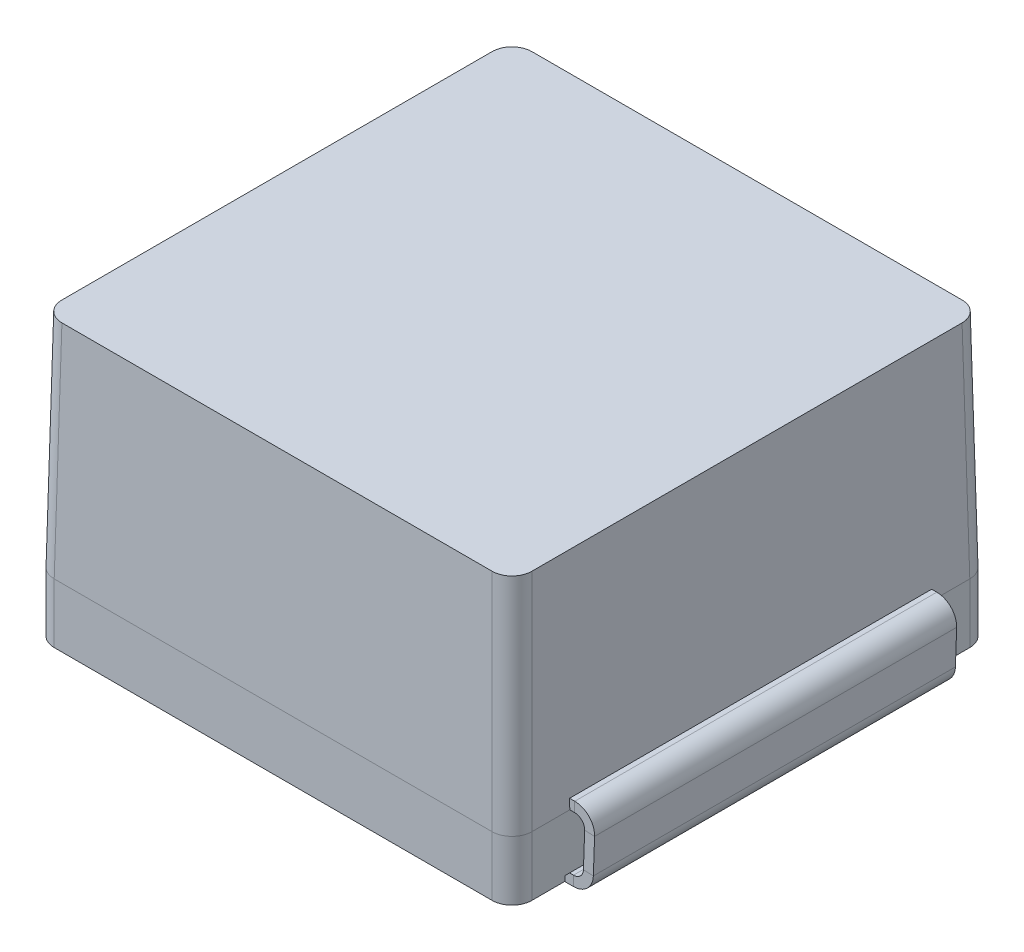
ISO-10303-21;
HEADER;
FILE_DESCRIPTION(('STEP AP214'),'2;1');
FILE_NAME('part.step','',(''),(''),'','','');
FILE_SCHEMA(('AUTOMOTIVE_DESIGN { 1 0 10303 214 1 1 1 1 }'));
ENDSEC;
DATA;
#1=APPLICATION_CONTEXT('core data for automotive mechanical design processes');
#2=APPLICATION_PROTOCOL_DEFINITION('international standard','automotive_design',2000,#1);
#3=PRODUCT_CONTEXT('',#1,'mechanical');
#4=PRODUCT('Part','Part','',(#3));
#5=PRODUCT_RELATED_PRODUCT_CATEGORY('part','',(#4));
#6=PRODUCT_DEFINITION_FORMATION('','',#4);
#7=PRODUCT_DEFINITION_CONTEXT('part definition',#1,'design');
#8=PRODUCT_DEFINITION('design','',#6,#7);
#9=PRODUCT_DEFINITION_SHAPE('','',#8);
#10=(LENGTH_UNIT() NAMED_UNIT(*) SI_UNIT(.MILLI.,.METRE.));
#11=(NAMED_UNIT(*) PLANE_ANGLE_UNIT() SI_UNIT($,.RADIAN.));
#12=(NAMED_UNIT(*) SI_UNIT($,.STERADIAN.) SOLID_ANGLE_UNIT());
#13=UNCERTAINTY_MEASURE_WITH_UNIT(LENGTH_MEASURE(1.E-05),#10,'distance_accuracy_value','');
#14=(GEOMETRIC_REPRESENTATION_CONTEXT(3) GLOBAL_UNCERTAINTY_ASSIGNED_CONTEXT((#13)) GLOBAL_UNIT_ASSIGNED_CONTEXT((#10,
#11,#12)) REPRESENTATION_CONTEXT('',''));
#15=CARTESIAN_POINT('',(0.,0.,0.));
#16=DIRECTION('',(0.,0.,1.));
#17=DIRECTION('',(1.,0.,0.));
#18=AXIS2_PLACEMENT_3D('',#15,#16,#17);
#19=CARTESIAN_POINT('',(-102.305939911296,29.0531963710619,33.2676142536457));
#20=DIRECTION('',(-0.999390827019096,-0.0348994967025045,0.));
#21=DIRECTION('',(0.,0.,1.));
#22=AXIS2_PLACEMENT_3D('',#19,#20,#21);
#23=PLANE('',#22);
#24=DIRECTION('',(-0.0348994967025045,0.999390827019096,0.));
#25=VECTOR('',#24,1.);
#26=CARTESIAN_POINT('',(-102.305939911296,29.0531963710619,42.5386142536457));
#27=LINE('',#26,#25);
#28=CARTESIAN_POINT('',(-101.765207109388,13.568634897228,42.5386142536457));
#29=VERTEX_POINT('',#28);
#30=CARTESIAN_POINT('',(-101.827549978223,15.3539010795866,42.5386142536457));
#31=VERTEX_POINT('',#30);
#32=EDGE_CURVE('P0_E33',#29,#31,#27,.T.);
#33=ORIENTED_EDGE('',*,*,#32,.F.);
#34=DIRECTION('',(0.,0.,-1.));
#35=VECTOR('',#34,1.);
#36=CARTESIAN_POINT('',(-101.765207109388,13.568634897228,33.2676142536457));
#37=LINE('',#36,#35);
#38=CARTESIAN_POINT('',(-101.765207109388,13.568634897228,23.9966142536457));
#39=VERTEX_POINT('',#38);
#40=EDGE_CURVE('P0_E25',#29,#39,#37,.T.);
#41=ORIENTED_EDGE('',*,*,#40,.T.);
#42=DIRECTION('',(-0.0348994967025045,0.999390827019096,0.));
#43=VECTOR('',#42,1.);
#44=CARTESIAN_POINT('',(-102.305939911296,29.0531963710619,23.9966142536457));
#45=LINE('',#44,#43);
#46=CARTESIAN_POINT('',(-101.827549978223,15.3539010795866,23.9966142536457));
#47=VERTEX_POINT('',#46);
#48=EDGE_CURVE('P0_E41',#47,#39,#45,.F.);
#49=ORIENTED_EDGE('',*,*,#48,.F.);
#50=DIRECTION('',(0.,0.,1.));
#51=VECTOR('',#50,1.);
#52=CARTESIAN_POINT('',(-101.827549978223,15.3539010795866,33.2676142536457));
#53=LINE('',#52,#51);
#54=EDGE_CURVE('P0_E239',#47,#31,#53,.T.);
#55=ORIENTED_EDGE('',*,*,#54,.T.);
#56=EDGE_LOOP('',(#33,#41,#49,#55));
#57=FACE_BOUND('',#56,.T.);
#58=ADVANCED_FACE('P0_F16',(#57),#23,.F.);
#59=CARTESIAN_POINT('',(-75.365578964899,29.0531963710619,33.2676142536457));
#60=DIRECTION('',(0.999390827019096,-0.0348994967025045,0.));
#61=DIRECTION('',(0.,0.,1.));
#62=AXIS2_PLACEMENT_3D('',#59,#60,#61);
#63=PLANE('',#62);
#64=DIRECTION('',(-0.0348994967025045,-0.999390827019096,0.));
#65=VECTOR('',#64,1.);
#66=CARTESIAN_POINT('',(-75.365578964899,29.0531963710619,23.9966142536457));
#67=LINE('',#66,#65);
#68=CARTESIAN_POINT('',(-75.9063117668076,13.5686348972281,23.9966142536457));
#69=VERTEX_POINT('',#68);
#70=CARTESIAN_POINT('',(-75.843968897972,15.3539010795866,23.9966142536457));
#71=VERTEX_POINT('',#70);
#72=EDGE_CURVE('P0_E332',#69,#71,#67,.F.);
#73=ORIENTED_EDGE('',*,*,#72,.F.);
#74=DIRECTION('',(0.,0.,1.));
#75=VECTOR('',#74,1.);
#76=CARTESIAN_POINT('',(-75.9063117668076,13.5686348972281,33.2676142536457));
#77=LINE('',#76,#75);
#78=CARTESIAN_POINT('',(-75.9063117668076,13.5686348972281,42.5386142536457));
#79=VERTEX_POINT('',#78);
#80=EDGE_CURVE('P0_E325',#69,#79,#77,.T.);
#81=ORIENTED_EDGE('',*,*,#80,.T.);
#82=DIRECTION('',(-0.0348994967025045,-0.999390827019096,0.));
#83=VECTOR('',#82,1.);
#84=CARTESIAN_POINT('',(-75.365578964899,29.0531963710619,42.5386142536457));
#85=LINE('',#84,#83);
#86=CARTESIAN_POINT('',(-75.843968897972,15.3539010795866,42.5386142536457));
#87=VERTEX_POINT('',#86);
#88=EDGE_CURVE('P0_E313',#87,#79,#85,.T.);
#89=ORIENTED_EDGE('',*,*,#88,.F.);
#90=DIRECTION('',(0.,0.,1.));
#91=VECTOR('',#90,1.);
#92=CARTESIAN_POINT('',(-75.843968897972,15.3539010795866,33.2676142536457));
#93=LINE('',#92,#91);
#94=EDGE_CURVE('P0_E295',#71,#87,#93,.T.);
#95=ORIENTED_EDGE('',*,*,#94,.F.);
#96=EDGE_LOOP('',(#73,#81,#89,#95));
#97=FACE_BOUND('',#96,.T.);
#98=ADVANCED_FACE('P0_F419',(#97),#63,.F.);
#99=CARTESIAN_POINT('',(-68.1855594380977,16.3876300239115,42.5386142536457));
#100=DIRECTION('',(0.,0.,1.));
#101=DIRECTION('',(1.,0.,0.));
#102=AXIS2_PLACEMENT_3D('',#99,#100,#101);
#103=PLANE('',#102);
#104=DIRECTION('',(1.,0.,0.));
#105=VECTOR('',#104,1.);
#106=CARTESIAN_POINT('',(-68.1855594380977,16.3876300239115,42.5386142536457));
#107=LINE('',#106,#105);
#108=CARTESIAN_POINT('',(-101.319859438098,16.3876300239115,42.5386142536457));
#109=VERTEX_POINT('',#108);
#110=CARTESIAN_POINT('',(-76.3516594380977,16.3876300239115,42.5386142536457));
#111=VERTEX_POINT('',#110);
#112=EDGE_CURVE('P0_E316',#109,#111,#107,.T.);
#113=ORIENTED_EDGE('',*,*,#112,.F.);
#114=DIRECTION('',(0.,-1.,0.));
#115=VECTOR('',#114,1.);
#116=CARTESIAN_POINT('',(-101.319859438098,16.3876300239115,42.5386142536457));
#117=LINE('',#116,#115);
#118=CARTESIAN_POINT('',(-101.319859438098,15.8796300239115,42.5386142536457));
#119=VERTEX_POINT('',#118);
#120=EDGE_CURVE('P0_E308',#109,#119,#117,.T.);
#121=ORIENTED_EDGE('',*,*,#120,.T.);
#122=DIRECTION('',(1.,0.,0.));
#123=VECTOR('',#122,1.);
#124=CARTESIAN_POINT('',(-88.8357594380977,15.8796300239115,42.5386142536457));
#125=LINE('',#124,#123);
#126=CARTESIAN_POINT('',(-76.3516594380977,15.8796300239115,42.5386142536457));
#127=VERTEX_POINT('',#126);
#128=EDGE_CURVE('P0_E277',#119,#127,#125,.T.);
#129=ORIENTED_EDGE('',*,*,#128,.T.);
#130=DIRECTION('',(0.,-1.,0.));
#131=VECTOR('',#130,1.);
#132=CARTESIAN_POINT('',(-76.3516594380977,16.3876300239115,42.5386142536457));
#133=LINE('',#132,#131);
#134=EDGE_CURVE('P0_E283',#111,#127,#133,.T.);
#135=ORIENTED_EDGE('',*,*,#134,.F.);
#136=EDGE_LOOP('',(#113,#121,#129,#135));
#137=FACE_BOUND('',#136,.T.);
#138=ADVANCED_FACE('P0_F361',(#137),#103,.T.);
#139=CARTESIAN_POINT('',(-68.1855594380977,16.3876300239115,23.9966142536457));
#140=DIRECTION('',(0.,0.,-1.));
#141=DIRECTION('',(-1.,0.,0.));
#142=AXIS2_PLACEMENT_3D('',#139,#140,#141);
#143=PLANE('',#142);
#144=DIRECTION('',(1.,0.,0.));
#145=VECTOR('',#144,1.);
#146=CARTESIAN_POINT('',(-88.8357594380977,15.8796300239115,23.9966142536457));
#147=LINE('',#146,#145);
#148=CARTESIAN_POINT('',(-76.3516594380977,15.8796300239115,23.9966142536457));
#149=VERTEX_POINT('',#148);
#150=CARTESIAN_POINT('',(-101.319859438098,15.8796300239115,23.9966142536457));
#151=VERTEX_POINT('',#150);
#152=EDGE_CURVE('P0_E278',#149,#151,#147,.F.);
#153=ORIENTED_EDGE('',*,*,#152,.T.);
#154=DIRECTION('',(0.,1.,0.));
#155=VECTOR('',#154,1.);
#156=CARTESIAN_POINT('',(-101.319859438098,16.3876300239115,23.9966142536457));
#157=LINE('',#156,#155);
#158=CARTESIAN_POINT('',(-101.319859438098,16.3876300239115,23.9966142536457));
#159=VERTEX_POINT('',#158);
#160=EDGE_CURVE('P0_E303',#151,#159,#157,.T.);
#161=ORIENTED_EDGE('',*,*,#160,.T.);
#162=DIRECTION('',(-1.,0.,0.));
#163=VECTOR('',#162,1.);
#164=CARTESIAN_POINT('',(-68.1855594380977,16.3876300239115,23.9966142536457));
#165=LINE('',#164,#163);
#166=CARTESIAN_POINT('',(-76.3516594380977,16.3876300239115,23.9966142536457));
#167=VERTEX_POINT('',#166);
#168=EDGE_CURVE('P0_E282',#167,#159,#165,.T.);
#169=ORIENTED_EDGE('',*,*,#168,.F.);
#170=DIRECTION('',(0.,1.,0.));
#171=VECTOR('',#170,1.);
#172=CARTESIAN_POINT('',(-76.3516594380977,16.3876300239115,23.9966142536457));
#173=LINE('',#172,#171);
#174=EDGE_CURVE('P0_E279',#149,#167,#173,.T.);
#175=ORIENTED_EDGE('',*,*,#174,.F.);
#176=EDGE_LOOP('',(#153,#161,#169,#175));
#177=FACE_BOUND('',#176,.T.);
#178=ADVANCED_FACE('P0_F368',(#177),#143,.T.);
#179=CARTESIAN_POINT('',(-88.8357594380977,16.3876300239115,33.2676142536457));
#180=DIRECTION('',(0.,1.,0.));
#181=DIRECTION('',(0.,0.,1.));
#182=AXIS2_PLACEMENT_3D('',#179,#180,#181);
#183=PLANE('',#182);
#184=ORIENTED_EDGE('',*,*,#168,.T.);
#185=DIRECTION('',(0.,0.,1.));
#186=VECTOR('',#185,1.);
#187=CARTESIAN_POINT('',(-101.319859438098,16.3876300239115,33.2676142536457));
#188=LINE('',#187,#186);
#189=EDGE_CURVE('P0_E300',#159,#109,#188,.T.);
#190=ORIENTED_EDGE('',*,*,#189,.T.);
#191=ORIENTED_EDGE('',*,*,#112,.T.);
#192=DIRECTION('',(0.,0.,1.));
#193=VECTOR('',#192,1.);
#194=CARTESIAN_POINT('',(-76.3516594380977,16.3876300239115,33.2676142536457));
#195=LINE('',#194,#193);
#196=EDGE_CURVE('P0_E269',#167,#111,#195,.T.);
#197=ORIENTED_EDGE('',*,*,#196,.F.);
#198=EDGE_LOOP('',(#184,#190,#191,#197));
#199=FACE_BOUND('',#198,.T.);
#200=ADVANCED_FACE('P0_F365',(#199),#183,.T.);
#201=CARTESIAN_POINT('',(-75.5785700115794,8.39784697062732,23.9966142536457));
#202=DIRECTION('',(0.,0.,-1.));
#203=DIRECTION('',(0.0348994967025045,0.999390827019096,0.));
#204=AXIS2_PLACEMENT_3D('',#201,#202,#203);
#205=PLANE('',#204);
#206=DIRECTION('',(0.999390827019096,-0.0348994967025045,0.));
#207=VECTOR('',#206,1.);
#208=CARTESIAN_POINT('',(-75.3986212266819,13.5509059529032,23.9966142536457));
#209=LINE('',#208,#207);
#210=CARTESIAN_POINT('',(-75.3986212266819,13.5509059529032,23.9966142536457));
#211=VERTEX_POINT('',#210);
#212=EDGE_CURVE('P0_E328',#69,#211,#209,.T.);
#213=ORIENTED_EDGE('',*,*,#212,.F.);
#214=ORIENTED_EDGE('',*,*,#72,.T.);
#215=DIRECTION('',(0.999390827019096,-0.0348994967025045,0.));
#216=VECTOR('',#215,1.);
#217=CARTESIAN_POINT('',(-75.3362783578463,15.3361721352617,23.9966142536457));
#218=LINE('',#217,#216);
#219=CARTESIAN_POINT('',(-75.3362783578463,15.3361721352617,23.9966142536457));
#220=VERTEX_POINT('',#219);
#221=EDGE_CURVE('P0_E291',#71,#220,#218,.T.);
#222=ORIENTED_EDGE('',*,*,#221,.T.);
#223=DIRECTION('',(0.0348994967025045,0.999390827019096,0.));
#224=VECTOR('',#223,1.);
#225=CARTESIAN_POINT('',(-75.5785700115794,8.39784697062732,23.9966142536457));
#226=LINE('',#225,#224);
#227=EDGE_CURVE('P0_E292',#211,#220,#226,.T.);
#228=ORIENTED_EDGE('',*,*,#227,.F.);
#229=EDGE_LOOP('',(#213,#214,#222,#228));
#230=FACE_BOUND('',#229,.T.);
#231=ADVANCED_FACE('P0_F430',(#230),#205,.T.);
#232=CARTESIAN_POINT('',(-75.5785700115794,8.39784697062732,42.5386142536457));
#233=DIRECTION('',(0.,0.,1.));
#234=DIRECTION('',(-0.0348994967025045,-0.999390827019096,0.));
#235=AXIS2_PLACEMENT_3D('',#232,#233,#234);
#236=PLANE('',#235);
#237=DIRECTION('',(-0.999390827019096,0.0348994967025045,0.));
#238=VECTOR('',#237,1.);
#239=CARTESIAN_POINT('',(-75.3986212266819,13.5509059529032,42.5386142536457));
#240=LINE('',#239,#238);
#241=CARTESIAN_POINT('',(-75.3986212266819,13.5509059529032,42.5386142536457));
#242=VERTEX_POINT('',#241);
#243=EDGE_CURVE('P0_E322',#242,#79,#240,.T.);
#244=ORIENTED_EDGE('',*,*,#243,.F.);
#245=DIRECTION('',(-0.0348994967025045,-0.999390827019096,0.));
#246=VECTOR('',#245,1.);
#247=CARTESIAN_POINT('',(-75.5785700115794,8.39784697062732,42.5386142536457));
#248=LINE('',#247,#246);
#249=CARTESIAN_POINT('',(-75.3362783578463,15.3361721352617,42.5386142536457));
#250=VERTEX_POINT('',#249);
#251=EDGE_CURVE('P0_E334',#250,#242,#248,.T.);
#252=ORIENTED_EDGE('',*,*,#251,.F.);
#253=DIRECTION('',(-0.999390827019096,0.0348994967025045,0.));
#254=VECTOR('',#253,1.);
#255=CARTESIAN_POINT('',(-75.3362783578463,15.3361721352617,42.5386142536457));
#256=LINE('',#255,#254);
#257=EDGE_CURVE('P0_E297',#250,#87,#256,.T.);
#258=ORIENTED_EDGE('',*,*,#257,.T.);
#259=ORIENTED_EDGE('',*,*,#88,.T.);
#260=EDGE_LOOP('',(#244,#252,#258,#259));
#261=FACE_BOUND('',#260,.T.);
#262=ADVANCED_FACE('P0_F432',(#261),#236,.T.);
#263=CARTESIAN_POINT('',(-74.8578884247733,29.035467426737,33.2676142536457));
#264=DIRECTION('',(0.999390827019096,-0.0348994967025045,0.));
#265=DIRECTION('',(0.,0.,1.));
#266=AXIS2_PLACEMENT_3D('',#263,#264,#265);
#267=PLANE('',#266);
#268=DIRECTION('',(0.,0.,1.));
#269=VECTOR('',#268,1.);
#270=CARTESIAN_POINT('',(-75.3986212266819,13.5509059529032,33.2676142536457));
#271=LINE('',#270,#269);
#272=EDGE_CURVE('P0_E311',#211,#242,#271,.T.);
#273=ORIENTED_EDGE('',*,*,#272,.F.);
#274=ORIENTED_EDGE('',*,*,#227,.T.);
#275=DIRECTION('',(0.,0.,1.));
#276=VECTOR('',#275,1.);
#277=CARTESIAN_POINT('',(-75.3362783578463,15.3361721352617,33.2676142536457));
#278=LINE('',#277,#276);
#279=EDGE_CURVE('P0_E288',#220,#250,#278,.T.);
#280=ORIENTED_EDGE('',*,*,#279,.T.);
#281=ORIENTED_EDGE('',*,*,#251,.T.);
#282=EDGE_LOOP('',(#273,#274,#280,#281));
#283=FACE_BOUND('',#282,.T.);
#284=ADVANCED_FACE('P0_F437',(#283),#267,.T.);
#285=CARTESIAN_POINT('',(-88.8357594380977,15.8796300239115,33.2676142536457));
#286=DIRECTION('',(0.,1.,0.));
#287=DIRECTION('',(0.,0.,1.));
#288=AXIS2_PLACEMENT_3D('',#285,#286,#287);
#289=PLANE('',#288);
#290=DIRECTION('',(0.,0.,1.));
#291=VECTOR('',#290,1.);
#292=CARTESIAN_POINT('',(-101.319859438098,15.8796300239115,33.2676142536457));
#293=LINE('',#292,#291);
#294=EDGE_CURVE('P0_E306',#151,#119,#293,.T.);
#295=ORIENTED_EDGE('',*,*,#294,.F.);
#296=ORIENTED_EDGE('',*,*,#152,.F.);
#297=DIRECTION('',(0.,0.,1.));
#298=VECTOR('',#297,1.);
#299=CARTESIAN_POINT('',(-76.3516594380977,15.8796300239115,33.2676142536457));
#300=LINE('',#299,#298);
#301=EDGE_CURVE('P0_E274',#149,#127,#300,.T.);
#302=ORIENTED_EDGE('',*,*,#301,.T.);
#303=ORIENTED_EDGE('',*,*,#128,.F.);
#304=EDGE_LOOP('',(#295,#296,#302,#303));
#305=FACE_BOUND('',#304,.T.);
#306=ADVANCED_FACE('P0_F441',(#305),#289,.F.);
#307=CARTESIAN_POINT('',(-76.3516594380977,15.3716300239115,23.9966142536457));
#308=DIRECTION('',(0.,0.,-1.));
#309=DIRECTION('',(-1.,0.,0.));
#310=AXIS2_PLACEMENT_3D('',#307,#308,#309);
#311=PLANE('',#310);
#312=ORIENTED_EDGE('',*,*,#221,.F.);
#313=CARTESIAN_POINT('',(-76.3516594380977,15.3716300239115,23.9966142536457));
#314=DIRECTION('',(0.,0.,-1.));
#315=DIRECTION('',(-1.,0.,0.));
#316=AXIS2_PLACEMENT_3D('',#313,#314,#315);
#317=CIRCLE('',#316,0.508);
#318=EDGE_CURVE('P0_E257',#71,#149,#317,.F.);
#319=ORIENTED_EDGE('',*,*,#318,.T.);
#320=ORIENTED_EDGE('',*,*,#174,.T.);
#321=CARTESIAN_POINT('',(-76.3516594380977,15.3716300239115,23.9966142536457));
#322=DIRECTION('',(0.,0.,1.));
#323=DIRECTION('',(1.,0.,0.));
#324=AXIS2_PLACEMENT_3D('',#321,#322,#323);
#325=CIRCLE('',#324,1.016);
#326=EDGE_CURVE('P0_E263',#220,#167,#325,.T.);
#327=ORIENTED_EDGE('',*,*,#326,.F.);
#328=EDGE_LOOP('',(#312,#319,#320,#327));
#329=FACE_BOUND('',#328,.T.);
#330=ADVANCED_FACE('P0_F447',(#329),#311,.T.);
#331=CARTESIAN_POINT('',(-76.3516594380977,15.3716300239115,42.5386142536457));
#332=DIRECTION('',(0.,0.,1.));
#333=DIRECTION('',(1.,0.,0.));
#334=AXIS2_PLACEMENT_3D('',#331,#332,#333);
#335=PLANE('',#334);
#336=CARTESIAN_POINT('',(-76.3516594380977,15.3716300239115,42.5386142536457));
#337=DIRECTION('',(0.,0.,-1.));
#338=DIRECTION('',(-1.,0.,0.));
#339=AXIS2_PLACEMENT_3D('',#336,#337,#338);
#340=CIRCLE('',#339,0.508);
#341=EDGE_CURVE('P0_E267',#127,#87,#340,.T.);
#342=ORIENTED_EDGE('',*,*,#341,.T.);
#343=ORIENTED_EDGE('',*,*,#257,.F.);
#344=CARTESIAN_POINT('',(-76.3516594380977,15.3716300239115,42.5386142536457));
#345=DIRECTION('',(0.,0.,-1.));
#346=DIRECTION('',(-1.,0.,0.));
#347=AXIS2_PLACEMENT_3D('',#344,#345,#346);
#348=CIRCLE('',#347,1.016);
#349=EDGE_CURVE('P0_E266',#111,#250,#348,.T.);
#350=ORIENTED_EDGE('',*,*,#349,.F.);
#351=ORIENTED_EDGE('',*,*,#134,.T.);
#352=EDGE_LOOP('',(#342,#343,#350,#351));
#353=FACE_BOUND('',#352,.T.);
#354=ADVANCED_FACE('P0_F453',(#353),#335,.T.);
#355=CARTESIAN_POINT('',(-76.3516594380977,15.3716300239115,51.8568824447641));
#356=DIRECTION('',(0.,0.,-1.));
#357=DIRECTION('',(-1.,0.,0.));
#358=AXIS2_PLACEMENT_3D('',#355,#356,#357);
#359=CYLINDRICAL_SURFACE('',#358,1.016);
#360=ORIENTED_EDGE('',*,*,#196,.T.);
#361=ORIENTED_EDGE('',*,*,#349,.T.);
#362=ORIENTED_EDGE('',*,*,#279,.F.);
#363=ORIENTED_EDGE('',*,*,#326,.T.);
#364=EDGE_LOOP('',(#360,#361,#362,#363));
#365=FACE_BOUND('',#364,.T.);
#366=ADVANCED_FACE('P0_F456',(#365),#359,.T.);
#367=CARTESIAN_POINT('',(-76.3516594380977,15.3716300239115,51.8568824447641));
#368=DIRECTION('',(0.,0.,-1.));
#369=DIRECTION('',(-1.,0.,0.));
#370=AXIS2_PLACEMENT_3D('',#367,#368,#369);
#371=CYLINDRICAL_SURFACE('',#370,0.508);
#372=ORIENTED_EDGE('',*,*,#301,.F.);
#373=ORIENTED_EDGE('',*,*,#318,.F.);
#374=ORIENTED_EDGE('',*,*,#94,.T.);
#375=ORIENTED_EDGE('',*,*,#341,.F.);
#376=EDGE_LOOP('',(#372,#373,#374,#375));
#377=FACE_BOUND('',#376,.T.);
#378=ADVANCED_FACE('P0_F461',(#377),#371,.F.);
#379=CARTESIAN_POINT('',(-101.319859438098,15.3716300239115,23.9966142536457));
#380=DIRECTION('',(0.,0.,-1.));
#381=DIRECTION('',(-1.,0.,0.));
#382=AXIS2_PLACEMENT_3D('',#379,#380,#381);
#383=PLANE('',#382);
#384=ORIENTED_EDGE('',*,*,#160,.F.);
#385=CARTESIAN_POINT('',(-101.319859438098,15.3716300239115,23.9966142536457));
#386=DIRECTION('',(0.,0.,1.));
#387=DIRECTION('',(1.,0.,0.));
#388=AXIS2_PLACEMENT_3D('',#385,#386,#387);
#389=CIRCLE('',#388,0.508);
#390=EDGE_CURVE('P0_E260',#151,#47,#389,.T.);
#391=ORIENTED_EDGE('',*,*,#390,.T.);
#392=DIRECTION('',(-0.999390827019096,-0.0348994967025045,0.));
#393=VECTOR('',#392,1.);
#394=CARTESIAN_POINT('',(-102.335240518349,15.3361721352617,23.9966142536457));
#395=LINE('',#394,#393);
#396=CARTESIAN_POINT('',(-102.335240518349,15.3361721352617,23.9966142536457));
#397=VERTEX_POINT('',#396);
#398=EDGE_CURVE('P0_E241',#47,#397,#395,.T.);
#399=ORIENTED_EDGE('',*,*,#398,.T.);
#400=CARTESIAN_POINT('',(-101.319859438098,15.3716300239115,23.9966142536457));
#401=DIRECTION('',(0.,0.,1.));
#402=DIRECTION('',(1.,0.,0.));
#403=AXIS2_PLACEMENT_3D('',#400,#401,#402);
#404=CIRCLE('',#403,1.016);
#405=EDGE_CURVE('P0_E250',#159,#397,#404,.T.);
#406=ORIENTED_EDGE('',*,*,#405,.F.);
#407=EDGE_LOOP('',(#384,#391,#399,#406));
#408=FACE_BOUND('',#407,.T.);
#409=ADVANCED_FACE('P0_F372',(#408),#383,.T.);
#410=CARTESIAN_POINT('',(-101.319859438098,15.3716300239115,42.5386142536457));
#411=DIRECTION('',(0.,0.,1.));
#412=DIRECTION('',(1.,0.,0.));
#413=AXIS2_PLACEMENT_3D('',#410,#411,#412);
#414=PLANE('',#413);
#415=DIRECTION('',(0.999390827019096,0.0348994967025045,0.));
#416=VECTOR('',#415,1.);
#417=CARTESIAN_POINT('',(-102.335240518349,15.3361721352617,42.5386142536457));
#418=LINE('',#417,#416);
#419=CARTESIAN_POINT('',(-102.335240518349,15.3361721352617,42.5386142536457));
#420=VERTEX_POINT('',#419);
#421=EDGE_CURVE('P0_E245',#420,#31,#418,.T.);
#422=ORIENTED_EDGE('',*,*,#421,.T.);
#423=CARTESIAN_POINT('',(-101.319859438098,15.3716300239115,42.5386142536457));
#424=DIRECTION('',(0.,0.,1.));
#425=DIRECTION('',(1.,0.,0.));
#426=AXIS2_PLACEMENT_3D('',#423,#424,#425);
#427=CIRCLE('',#426,0.508);
#428=EDGE_CURVE('P0_E254',#31,#119,#427,.F.);
#429=ORIENTED_EDGE('',*,*,#428,.T.);
#430=ORIENTED_EDGE('',*,*,#120,.F.);
#431=CARTESIAN_POINT('',(-101.319859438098,15.3716300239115,42.5386142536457));
#432=DIRECTION('',(0.,0.,-1.));
#433=DIRECTION('',(-1.,0.,0.));
#434=AXIS2_PLACEMENT_3D('',#431,#432,#433);
#435=CIRCLE('',#434,1.016);
#436=EDGE_CURVE('P0_E253',#420,#109,#435,.T.);
#437=ORIENTED_EDGE('',*,*,#436,.F.);
#438=EDGE_LOOP('',(#422,#429,#430,#437));
#439=FACE_BOUND('',#438,.T.);
#440=ADVANCED_FACE('P0_F357',(#439),#414,.T.);
#441=CARTESIAN_POINT('',(-101.319859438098,15.3716300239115,14.6783460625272));
#442=DIRECTION('',(0.,0.,1.));
#443=DIRECTION('',(1.,0.,0.));
#444=AXIS2_PLACEMENT_3D('',#441,#442,#443);
#445=CYLINDRICAL_SURFACE('',#444,1.016);
#446=ORIENTED_EDGE('',*,*,#436,.T.);
#447=ORIENTED_EDGE('',*,*,#189,.F.);
#448=ORIENTED_EDGE('',*,*,#405,.T.);
#449=DIRECTION('',(0.,0.,1.));
#450=VECTOR('',#449,1.);
#451=CARTESIAN_POINT('',(-102.335240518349,15.3361721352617,33.2676142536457));
#452=LINE('',#451,#450);
#453=EDGE_CURVE('P0_E234',#397,#420,#452,.T.);
#454=ORIENTED_EDGE('',*,*,#453,.T.);
#455=EDGE_LOOP('',(#446,#447,#448,#454));
#456=FACE_BOUND('',#455,.T.);
#457=ADVANCED_FACE('P0_F355',(#456),#445,.T.);
#458=CARTESIAN_POINT('',(-101.319859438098,15.3716300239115,14.6783460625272));
#459=DIRECTION('',(0.,0.,1.));
#460=DIRECTION('',(1.,0.,0.));
#461=AXIS2_PLACEMENT_3D('',#458,#459,#460);
#462=CYLINDRICAL_SURFACE('',#461,0.508);
#463=ORIENTED_EDGE('',*,*,#428,.F.);
#464=ORIENTED_EDGE('',*,*,#54,.F.);
#465=ORIENTED_EDGE('',*,*,#390,.F.);
#466=ORIENTED_EDGE('',*,*,#294,.T.);
#467=EDGE_LOOP('',(#463,#464,#465,#466));
#468=FACE_BOUND('',#467,.T.);
#469=ADVANCED_FACE('P0_F375',(#468),#462,.F.);
#470=CARTESIAN_POINT('',(-102.813630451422,29.035467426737,33.2676142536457));
#471=DIRECTION('',(-0.999390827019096,-0.0348994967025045,0.));
#472=DIRECTION('',(0.,0.,1.));
#473=AXIS2_PLACEMENT_3D('',#470,#471,#472);
#474=PLANE('',#473);
#475=DIRECTION('',(0.,0.,-1.));
#476=VECTOR('',#475,1.);
#477=CARTESIAN_POINT('',(-102.272897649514,13.5509059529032,33.2676142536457));
#478=LINE('',#477,#476);
#479=CARTESIAN_POINT('',(-102.272897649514,13.5509059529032,42.5386142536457));
#480=VERTEX_POINT('',#479);
#481=CARTESIAN_POINT('',(-102.272897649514,13.5509059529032,23.9966142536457));
#482=VERTEX_POINT('',#481);
#483=EDGE_CURVE('P0_E331',#480,#482,#478,.T.);
#484=ORIENTED_EDGE('',*,*,#483,.F.);
#485=DIRECTION('',(-0.0348994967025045,0.999390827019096,0.));
#486=VECTOR('',#485,1.);
#487=CARTESIAN_POINT('',(-103.534312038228,49.6730878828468,42.5386142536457));
#488=LINE('',#487,#486);
#489=EDGE_CURVE('P0_E20',#480,#420,#488,.T.);
#490=ORIENTED_EDGE('',*,*,#489,.T.);
#491=ORIENTED_EDGE('',*,*,#453,.F.);
#492=DIRECTION('',(0.0348994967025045,-0.999390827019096,0.));
#493=VECTOR('',#492,1.);
#494=CARTESIAN_POINT('',(-103.534312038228,49.6730878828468,23.9966142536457));
#495=LINE('',#494,#493);
#496=EDGE_CURVE('P0_E244',#397,#482,#495,.T.);
#497=ORIENTED_EDGE('',*,*,#496,.T.);
#498=EDGE_LOOP('',(#484,#490,#491,#497));
#499=FACE_BOUND('',#498,.T.);
#500=ADVANCED_FACE('P0_F349',(#499),#474,.T.);
#501=CARTESIAN_POINT('',(-103.534312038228,49.6730878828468,23.9966142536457));
#502=DIRECTION('',(0.,0.,-1.));
#503=DIRECTION('',(0.0348994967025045,-0.999390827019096,0.));
#504=AXIS2_PLACEMENT_3D('',#501,#502,#503);
#505=PLANE('',#504);
#506=DIRECTION('',(0.999390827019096,0.0348994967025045,0.));
#507=VECTOR('',#506,1.);
#508=CARTESIAN_POINT('',(-102.272897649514,13.5509059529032,23.9966142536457));
#509=LINE('',#508,#507);
#510=EDGE_CURVE('P0_E340',#482,#39,#509,.T.);
#511=ORIENTED_EDGE('',*,*,#510,.F.);
#512=ORIENTED_EDGE('',*,*,#496,.F.);
#513=ORIENTED_EDGE('',*,*,#398,.F.);
#514=ORIENTED_EDGE('',*,*,#48,.T.);
#515=EDGE_LOOP('',(#511,#512,#513,#514));
#516=FACE_BOUND('',#515,.T.);
#517=ADVANCED_FACE('P0_F377',(#516),#505,.T.);
#518=CARTESIAN_POINT('',(-103.534312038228,49.6730878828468,42.5386142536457));
#519=DIRECTION('',(0.,0.,1.));
#520=DIRECTION('',(-0.0348994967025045,0.999390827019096,0.));
#521=AXIS2_PLACEMENT_3D('',#518,#519,#520);
#522=PLANE('',#521);
#523=DIRECTION('',(-0.999390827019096,-0.0348994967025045,0.));
#524=VECTOR('',#523,1.);
#525=CARTESIAN_POINT('',(-102.272897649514,13.5509059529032,42.5386142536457));
#526=LINE('',#525,#524);
#527=EDGE_CURVE('P0_E10',#29,#480,#526,.T.);
#528=ORIENTED_EDGE('',*,*,#527,.F.);
#529=ORIENTED_EDGE('',*,*,#32,.T.);
#530=ORIENTED_EDGE('',*,*,#421,.F.);
#531=ORIENTED_EDGE('',*,*,#489,.F.);
#532=EDGE_LOOP('',(#528,#529,#530,#531));
#533=FACE_BOUND('',#532,.T.);
#534=ADVANCED_FACE('P0_F18',(#533),#522,.T.);
#535=CARTESIAN_POINT('',(-76.4140023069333,13.5863638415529,23.9966142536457));
#536=DIRECTION('',(0.,0.,-1.));
#537=DIRECTION('',(-1.,0.,0.));
#538=AXIS2_PLACEMENT_3D('',#535,#536,#537);
#539=PLANE('',#538);
#540=DIRECTION('',(0.,-1.,0.));
#541=VECTOR('',#540,1.);
#542=CARTESIAN_POINT('',(-76.4140023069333,12.5703638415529,23.9966142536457));
#543=LINE('',#542,#541);
#544=CARTESIAN_POINT('',(-76.4140023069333,13.0783638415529,23.9966142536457));
#545=VERTEX_POINT('',#544);
#546=CARTESIAN_POINT('',(-76.4140023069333,12.5703638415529,23.9966142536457));
#547=VERTEX_POINT('',#546);
#548=EDGE_CURVE('P0_E197',#545,#547,#543,.T.);
#549=ORIENTED_EDGE('',*,*,#548,.F.);
#550=CARTESIAN_POINT('',(-76.4140023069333,13.5863638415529,23.9966142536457));
#551=DIRECTION('',(0.,0.,-1.));
#552=DIRECTION('',(-1.,0.,0.));
#553=AXIS2_PLACEMENT_3D('',#550,#551,#552);
#554=CIRCLE('',#553,0.508);
#555=EDGE_CURVE('P0_E199',#545,#69,#554,.F.);
#556=ORIENTED_EDGE('',*,*,#555,.T.);
#557=ORIENTED_EDGE('',*,*,#212,.T.);
#558=CARTESIAN_POINT('',(-76.4140023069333,13.5863638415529,23.9966142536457));
#559=DIRECTION('',(0.,0.,1.));
#560=DIRECTION('',(1.,0.,0.));
#561=AXIS2_PLACEMENT_3D('',#558,#559,#560);
#562=CIRCLE('',#561,1.016);
#563=EDGE_CURVE('P0_E227',#547,#211,#562,.T.);
#564=ORIENTED_EDGE('',*,*,#563,.F.);
#565=EDGE_LOOP('',(#549,#556,#557,#564));
#566=FACE_BOUND('',#565,.T.);
#567=ADVANCED_FACE('P0_F480',(#566),#539,.T.);
#568=CARTESIAN_POINT('',(-76.4140023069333,13.5863638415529,42.5386142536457));
#569=DIRECTION('',(0.,0.,1.));
#570=DIRECTION('',(1.,0.,0.));
#571=AXIS2_PLACEMENT_3D('',#568,#569,#570);
#572=PLANE('',#571);
#573=CARTESIAN_POINT('',(-76.4140023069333,13.5863638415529,42.5386142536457));
#574=DIRECTION('',(0.,0.,-1.));
#575=DIRECTION('',(-1.,0.,0.));
#576=AXIS2_PLACEMENT_3D('',#573,#574,#575);
#577=CIRCLE('',#576,0.508);
#578=CARTESIAN_POINT('',(-76.4140023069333,13.0783638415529,42.5386142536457));
#579=VERTEX_POINT('',#578);
#580=EDGE_CURVE('P0_E231',#79,#579,#577,.T.);
#581=ORIENTED_EDGE('',*,*,#580,.T.);
#582=DIRECTION('',(0.,1.,0.));
#583=VECTOR('',#582,1.);
#584=CARTESIAN_POINT('',(-76.4140023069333,12.5703638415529,42.5386142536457));
#585=LINE('',#584,#583);
#586=CARTESIAN_POINT('',(-76.4140023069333,12.5703638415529,42.5386142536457));
#587=VERTEX_POINT('',#586);
#588=EDGE_CURVE('P0_E207',#587,#579,#585,.T.);
#589=ORIENTED_EDGE('',*,*,#588,.F.);
#590=CARTESIAN_POINT('',(-76.4140023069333,13.5863638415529,42.5386142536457));
#591=DIRECTION('',(0.,0.,-1.));
#592=DIRECTION('',(-1.,0.,0.));
#593=AXIS2_PLACEMENT_3D('',#590,#591,#592);
#594=CIRCLE('',#593,1.016);
#595=EDGE_CURVE('P0_E230',#242,#587,#594,.T.);
#596=ORIENTED_EDGE('',*,*,#595,.F.);
#597=ORIENTED_EDGE('',*,*,#243,.T.);
#598=EDGE_LOOP('',(#581,#589,#596,#597));
#599=FACE_BOUND('',#598,.T.);
#600=ADVANCED_FACE('P0_F476',(#599),#572,.T.);
#601=CARTESIAN_POINT('',(-76.4140023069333,13.5863638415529,51.8556880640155));
#602=DIRECTION('',(0.,0.,-1.));
#603=DIRECTION('',(-1.,0.,0.));
#604=AXIS2_PLACEMENT_3D('',#601,#602,#603);
#605=CYLINDRICAL_SURFACE('',#604,1.016);
#606=ORIENTED_EDGE('',*,*,#272,.T.);
#607=ORIENTED_EDGE('',*,*,#595,.T.);
#608=DIRECTION('',(0.,0.,1.));
#609=VECTOR('',#608,1.);
#610=CARTESIAN_POINT('',(-76.4140023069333,12.5703638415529,33.2676142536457));
#611=LINE('',#610,#609);
#612=EDGE_CURVE('P0_E215',#547,#587,#611,.T.);
#613=ORIENTED_EDGE('',*,*,#612,.F.);
#614=ORIENTED_EDGE('',*,*,#563,.T.);
#615=EDGE_LOOP('',(#606,#607,#613,#614));
#616=FACE_BOUND('',#615,.T.);
#617=ADVANCED_FACE('P0_F479',(#616),#605,.T.);
#618=CARTESIAN_POINT('',(-76.4140023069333,13.5863638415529,51.8556880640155));
#619=DIRECTION('',(0.,0.,-1.));
#620=DIRECTION('',(-1.,0.,0.));
#621=AXIS2_PLACEMENT_3D('',#618,#619,#620);
#622=CYLINDRICAL_SURFACE('',#621,0.508);
#623=ORIENTED_EDGE('',*,*,#80,.F.);
#624=ORIENTED_EDGE('',*,*,#555,.F.);
#625=DIRECTION('',(0.,0.,1.));
#626=VECTOR('',#625,1.);
#627=CARTESIAN_POINT('',(-76.4140023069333,13.0783638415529,33.2676142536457));
#628=LINE('',#627,#626);
#629=EDGE_CURVE('P0_E191',#545,#579,#628,.T.);
#630=ORIENTED_EDGE('',*,*,#629,.T.);
#631=ORIENTED_EDGE('',*,*,#580,.F.);
#632=EDGE_LOOP('',(#623,#624,#630,#631));
#633=FACE_BOUND('',#632,.T.);
#634=ADVANCED_FACE('P0_F485',(#633),#622,.F.);
#635=CARTESIAN_POINT('',(-80.399854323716,12.570363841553,42.5386142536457));
#636=DIRECTION('',(-1.,0.,0.));
#637=DIRECTION('',(0.,0.,-1.));
#638=AXIS2_PLACEMENT_3D('',#635,#636,#637);
#639=PLANE('',#638);
#640=DIRECTION('',(0.,-1.,0.));
#641=VECTOR('',#640,1.);
#642=CARTESIAN_POINT('',(-80.399854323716,12.570363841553,42.5386142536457));
#643=LINE('',#642,#641);
#644=CARTESIAN_POINT('',(-80.399854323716,13.078363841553,42.5386142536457));
#645=VERTEX_POINT('',#644);
#646=CARTESIAN_POINT('',(-80.399854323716,12.570363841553,42.5386142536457));
#647=VERTEX_POINT('',#646);
#648=EDGE_CURVE('P0_E202',#645,#647,#643,.T.);
#649=ORIENTED_EDGE('',*,*,#648,.F.);
#650=DIRECTION('',(0.,0.,1.));
#651=VECTOR('',#650,1.);
#652=CARTESIAN_POINT('',(-80.399854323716,13.078363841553,33.2676142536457));
#653=LINE('',#652,#651);
#654=CARTESIAN_POINT('',(-80.399854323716,13.078363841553,23.9966142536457));
#655=VERTEX_POINT('',#654);
#656=EDGE_CURVE('P0_E222',#645,#655,#653,.F.);
#657=ORIENTED_EDGE('',*,*,#656,.T.);
#658=DIRECTION('',(0.,-1.,0.));
#659=VECTOR('',#658,1.);
#660=CARTESIAN_POINT('',(-80.399854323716,12.570363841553,23.9966142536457));
#661=LINE('',#660,#659);
#662=CARTESIAN_POINT('',(-80.399854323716,12.570363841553,23.9966142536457));
#663=VERTEX_POINT('',#662);
#664=EDGE_CURVE('P0_E220',#655,#663,#661,.T.);
#665=ORIENTED_EDGE('',*,*,#664,.T.);
#666=DIRECTION('',(0.,0.,-1.));
#667=VECTOR('',#666,1.);
#668=CARTESIAN_POINT('',(-80.399854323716,12.570363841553,42.5386142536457));
#669=LINE('',#668,#667);
#670=EDGE_CURVE('P0_E210',#647,#663,#669,.T.);
#671=ORIENTED_EDGE('',*,*,#670,.F.);
#672=EDGE_LOOP('',(#649,#657,#665,#671));
#673=FACE_BOUND('',#672,.T.);
#674=ADVANCED_FACE('P0_F488',(#673),#639,.T.);
#675=CARTESIAN_POINT('',(-59.749654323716,12.5703638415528,33.2676142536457));
#676=DIRECTION('',(0.,-1.,0.));
#677=DIRECTION('',(0.,0.,1.));
#678=AXIS2_PLACEMENT_3D('',#675,#676,#677);
#679=PLANE('',#678);
#680=DIRECTION('',(1.,0.,0.));
#681=VECTOR('',#680,1.);
#682=CARTESIAN_POINT('',(-80.399854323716,12.570363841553,23.9966142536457));
#683=LINE('',#682,#681);
#684=EDGE_CURVE('P0_E217',#663,#547,#683,.T.);
#685=ORIENTED_EDGE('',*,*,#684,.T.);
#686=ORIENTED_EDGE('',*,*,#612,.T.);
#687=DIRECTION('',(-1.,0.,0.));
#688=VECTOR('',#687,1.);
#689=CARTESIAN_POINT('',(-80.399854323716,12.570363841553,42.5386142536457));
#690=LINE('',#689,#688);
#691=EDGE_CURVE('P0_E213',#587,#647,#690,.T.);
#692=ORIENTED_EDGE('',*,*,#691,.T.);
#693=ORIENTED_EDGE('',*,*,#670,.T.);
#694=EDGE_LOOP('',(#685,#686,#692,#693));
#695=FACE_BOUND('',#694,.T.);
#696=ADVANCED_FACE('P0_F504',(#695),#679,.T.);
#697=CARTESIAN_POINT('',(-80.399854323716,12.570363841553,42.5386142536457));
#698=DIRECTION('',(0.,0.,1.));
#699=DIRECTION('',(-1.,0.,0.));
#700=AXIS2_PLACEMENT_3D('',#697,#698,#699);
#701=PLANE('',#700);
#702=ORIENTED_EDGE('',*,*,#691,.F.);
#703=ORIENTED_EDGE('',*,*,#588,.T.);
#704=DIRECTION('',(-1.,0.,0.));
#705=VECTOR('',#704,1.);
#706=CARTESIAN_POINT('',(-59.749654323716,13.0783638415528,42.5386142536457));
#707=LINE('',#706,#705);
#708=EDGE_CURVE('P0_E205',#579,#645,#707,.T.);
#709=ORIENTED_EDGE('',*,*,#708,.T.);
#710=ORIENTED_EDGE('',*,*,#648,.T.);
#711=EDGE_LOOP('',(#702,#703,#709,#710));
#712=FACE_BOUND('',#711,.T.);
#713=ADVANCED_FACE('P0_F500',(#712),#701,.T.);
#714=CARTESIAN_POINT('',(-59.749654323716,13.0783638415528,33.2676142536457));
#715=DIRECTION('',(0.,-1.,0.));
#716=DIRECTION('',(0.,0.,1.));
#717=AXIS2_PLACEMENT_3D('',#714,#715,#716);
#718=PLANE('',#717);
#719=ORIENTED_EDGE('',*,*,#629,.F.);
#720=DIRECTION('',(-1.,0.,0.));
#721=VECTOR('',#720,1.);
#722=CARTESIAN_POINT('',(-59.749654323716,13.0783638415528,23.9966142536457));
#723=LINE('',#722,#721);
#724=EDGE_CURVE('P0_E200',#655,#545,#723,.F.);
#725=ORIENTED_EDGE('',*,*,#724,.F.);
#726=ORIENTED_EDGE('',*,*,#656,.F.);
#727=ORIENTED_EDGE('',*,*,#708,.F.);
#728=EDGE_LOOP('',(#719,#725,#726,#727));
#729=FACE_BOUND('',#728,.T.);
#730=ADVANCED_FACE('P0_F496',(#729),#718,.F.);
#731=CARTESIAN_POINT('',(-80.399854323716,12.570363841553,23.9966142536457));
#732=DIRECTION('',(0.,0.,-1.));
#733=DIRECTION('',(1.,0.,0.));
#734=AXIS2_PLACEMENT_3D('',#731,#732,#733);
#735=PLANE('',#734);
#736=ORIENTED_EDGE('',*,*,#724,.T.);
#737=ORIENTED_EDGE('',*,*,#548,.T.);
#738=ORIENTED_EDGE('',*,*,#684,.F.);
#739=ORIENTED_EDGE('',*,*,#664,.F.);
#740=EDGE_LOOP('',(#736,#737,#738,#739));
#741=FACE_BOUND('',#740,.T.);
#742=ADVANCED_FACE('P0_F493',(#741),#735,.T.);
#743=CARTESIAN_POINT('',(-101.257516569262,13.5863638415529,42.5386142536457));
#744=DIRECTION('',(0.,0.,1.));
#745=DIRECTION('',(1.,0.,0.));
#746=AXIS2_PLACEMENT_3D('',#743,#744,#745);
#747=PLANE('',#746);
#748=DIRECTION('',(0.,-1.,0.));
#749=VECTOR('',#748,1.);
#750=CARTESIAN_POINT('',(-101.257516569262,12.5703638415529,42.5386142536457));
#751=LINE('',#750,#749);
#752=CARTESIAN_POINT('',(-101.257516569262,13.0783638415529,42.5386142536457));
#753=VERTEX_POINT('',#752);
#754=CARTESIAN_POINT('',(-101.257516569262,12.5703638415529,42.5386142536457));
#755=VERTEX_POINT('',#754);
#756=EDGE_CURVE('P0_E174',#753,#755,#751,.T.);
#757=ORIENTED_EDGE('',*,*,#756,.F.);
#758=CARTESIAN_POINT('',(-101.257516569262,13.5863638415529,42.5386142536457));
#759=DIRECTION('',(0.,0.,1.));
#760=DIRECTION('',(0.,-1.,0.));
#761=AXIS2_PLACEMENT_3D('',#758,#759,#760);
#762=CIRCLE('',#761,0.508);
#763=EDGE_CURVE('P0_E192',#753,#29,#762,.F.);
#764=ORIENTED_EDGE('',*,*,#763,.T.);
#765=ORIENTED_EDGE('',*,*,#527,.T.);
#766=CARTESIAN_POINT('',(-101.257516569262,13.5863638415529,42.5386142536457));
#767=DIRECTION('',(0.,0.,-1.));
#768=DIRECTION('',(-1.,0.,0.));
#769=AXIS2_PLACEMENT_3D('',#766,#767,#768);
#770=CIRCLE('',#769,1.016);
#771=EDGE_CURVE('P0_E184',#755,#480,#770,.T.);
#772=ORIENTED_EDGE('',*,*,#771,.F.);
#773=EDGE_LOOP('',(#757,#764,#765,#772));
#774=FACE_BOUND('',#773,.T.);
#775=ADVANCED_FACE('P0_F404',(#774),#747,.T.);
#776=CARTESIAN_POINT('',(-101.257516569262,13.5863638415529,23.9966142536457));
#777=DIRECTION('',(0.,0.,-1.));
#778=DIRECTION('',(-1.,0.,0.));
#779=AXIS2_PLACEMENT_3D('',#776,#777,#778);
#780=PLANE('',#779);
#781=CARTESIAN_POINT('',(-101.257516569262,13.5863638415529,23.9966142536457));
#782=DIRECTION('',(0.,0.,1.));
#783=DIRECTION('',(0.,-1.,0.));
#784=AXIS2_PLACEMENT_3D('',#781,#782,#783);
#785=CIRCLE('',#784,0.508);
#786=CARTESIAN_POINT('',(-101.257516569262,13.0783638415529,23.9966142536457));
#787=VERTEX_POINT('',#786);
#788=EDGE_CURVE('P0_E188',#39,#787,#785,.T.);
#789=ORIENTED_EDGE('',*,*,#788,.T.);
#790=DIRECTION('',(0.,1.,0.));
#791=VECTOR('',#790,1.);
#792=CARTESIAN_POINT('',(-101.257516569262,12.5703638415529,23.9966142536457));
#793=LINE('',#792,#791);
#794=CARTESIAN_POINT('',(-101.257516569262,12.5703638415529,23.9966142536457));
#795=VERTEX_POINT('',#794);
#796=EDGE_CURVE('P0_E388',#795,#787,#793,.T.);
#797=ORIENTED_EDGE('',*,*,#796,.F.);
#798=CARTESIAN_POINT('',(-101.257516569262,13.5863638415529,23.9966142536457));
#799=DIRECTION('',(0.,0.,1.));
#800=DIRECTION('',(1.,0.,0.));
#801=AXIS2_PLACEMENT_3D('',#798,#799,#800);
#802=CIRCLE('',#801,1.016);
#803=EDGE_CURVE('P0_E187',#482,#795,#802,.T.);
#804=ORIENTED_EDGE('',*,*,#803,.F.);
#805=ORIENTED_EDGE('',*,*,#510,.T.);
#806=EDGE_LOOP('',(#789,#797,#804,#805));
#807=FACE_BOUND('',#806,.T.);
#808=ADVANCED_FACE('P0_F386',(#807),#780,.T.);
#809=CARTESIAN_POINT('',(-101.257516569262,13.5863638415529,14.6795404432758));
#810=DIRECTION('',(0.,0.,1.));
#811=DIRECTION('',(0.,-1.,0.));
#812=AXIS2_PLACEMENT_3D('',#809,#810,#811);
#813=CYLINDRICAL_SURFACE('',#812,1.016);
#814=ORIENTED_EDGE('',*,*,#483,.T.);
#815=ORIENTED_EDGE('',*,*,#803,.T.);
#816=DIRECTION('',(0.,0.,-1.));
#817=VECTOR('',#816,1.);
#818=CARTESIAN_POINT('',(-101.257516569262,12.5703638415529,33.2676142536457));
#819=LINE('',#818,#817);
#820=EDGE_CURVE('P0_E400',#755,#795,#819,.T.);
#821=ORIENTED_EDGE('',*,*,#820,.F.);
#822=ORIENTED_EDGE('',*,*,#771,.T.);
#823=EDGE_LOOP('',(#814,#815,#821,#822));
#824=FACE_BOUND('',#823,.T.);
#825=ADVANCED_FACE('P0_F382',(#824),#813,.T.);
#826=CARTESIAN_POINT('',(-101.257516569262,13.5863638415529,14.6795404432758));
#827=DIRECTION('',(0.,0.,1.));
#828=DIRECTION('',(0.,-1.,0.));
#829=AXIS2_PLACEMENT_3D('',#826,#827,#828);
#830=CYLINDRICAL_SURFACE('',#829,0.508);
#831=ORIENTED_EDGE('',*,*,#40,.F.);
#832=ORIENTED_EDGE('',*,*,#763,.F.);
#833=DIRECTION('',(0.,0.,-1.));
#834=VECTOR('',#833,1.);
#835=CARTESIAN_POINT('',(-101.257516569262,13.0783638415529,33.2676142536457));
#836=LINE('',#835,#834);
#837=EDGE_CURVE('P0_E172',#753,#787,#836,.T.);
#838=ORIENTED_EDGE('',*,*,#837,.T.);
#839=ORIENTED_EDGE('',*,*,#788,.F.);
#840=EDGE_LOOP('',(#831,#832,#838,#839));
#841=FACE_BOUND('',#840,.T.);
#842=ADVANCED_FACE('P0_F407',(#841),#830,.F.);
#843=CARTESIAN_POINT('',(-97.2716645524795,12.5703638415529,42.5386142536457));
#844=DIRECTION('',(1.,0.,0.));
#845=DIRECTION('',(0.,0.,1.));
#846=AXIS2_PLACEMENT_3D('',#843,#844,#845);
#847=PLANE('',#846);
#848=DIRECTION('',(0.,-1.,0.));
#849=VECTOR('',#848,1.);
#850=CARTESIAN_POINT('',(-97.2716645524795,12.5703638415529,23.9966142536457));
#851=LINE('',#850,#849);
#852=CARTESIAN_POINT('',(-97.2716645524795,13.0783638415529,23.9966142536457));
#853=VERTEX_POINT('',#852);
#854=CARTESIAN_POINT('',(-97.2716645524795,12.5703638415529,23.9966142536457));
#855=VERTEX_POINT('',#854);
#856=EDGE_CURVE('P0_E175',#853,#855,#851,.T.);
#857=ORIENTED_EDGE('',*,*,#856,.F.);
#858=DIRECTION('',(0.,0.,1.));
#859=VECTOR('',#858,1.);
#860=CARTESIAN_POINT('',(-97.2716645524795,13.0783638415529,33.2676142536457));
#861=LINE('',#860,#859);
#862=CARTESIAN_POINT('',(-97.2716645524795,13.0783638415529,42.5386142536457));
#863=VERTEX_POINT('',#862);
#864=EDGE_CURVE('P0_E166',#853,#863,#861,.T.);
#865=ORIENTED_EDGE('',*,*,#864,.T.);
#866=DIRECTION('',(0.,-1.,0.));
#867=VECTOR('',#866,1.);
#868=CARTESIAN_POINT('',(-97.2716645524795,12.5703638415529,42.5386142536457));
#869=LINE('',#868,#867);
#870=CARTESIAN_POINT('',(-97.2716645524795,12.5703638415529,42.5386142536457));
#871=VERTEX_POINT('',#870);
#872=EDGE_CURVE('P0_E155',#863,#871,#869,.T.);
#873=ORIENTED_EDGE('',*,*,#872,.T.);
#874=DIRECTION('',(0.,0.,1.));
#875=VECTOR('',#874,1.);
#876=CARTESIAN_POINT('',(-97.2716645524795,12.5703638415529,42.5386142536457));
#877=LINE('',#876,#875);
#878=EDGE_CURVE('P0_E392',#855,#871,#877,.T.);
#879=ORIENTED_EDGE('',*,*,#878,.F.);
#880=EDGE_LOOP('',(#857,#865,#873,#879));
#881=FACE_BOUND('',#880,.T.);
#882=ADVANCED_FACE('P0_F178',(#881),#847,.T.);
#883=CARTESIAN_POINT('',(-117.92186455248,12.5703638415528,33.2676142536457));
#884=DIRECTION('',(0.,-1.,0.));
#885=DIRECTION('',(0.,0.,1.));
#886=AXIS2_PLACEMENT_3D('',#883,#884,#885);
#887=PLANE('',#886);
#888=DIRECTION('',(-1.,0.,0.));
#889=VECTOR('',#888,1.);
#890=CARTESIAN_POINT('',(-138.57206455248,12.5703638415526,42.5386142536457));
#891=LINE('',#890,#889);
#892=EDGE_CURVE('P0_E161',#871,#755,#891,.T.);
#893=ORIENTED_EDGE('',*,*,#892,.T.);
#894=ORIENTED_EDGE('',*,*,#820,.T.);
#895=DIRECTION('',(1.,0.,0.));
#896=VECTOR('',#895,1.);
#897=CARTESIAN_POINT('',(-138.57206455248,12.5703638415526,23.9966142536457));
#898=LINE('',#897,#896);
#899=EDGE_CURVE('P0_E395',#795,#855,#898,.T.);
#900=ORIENTED_EDGE('',*,*,#899,.T.);
#901=ORIENTED_EDGE('',*,*,#878,.T.);
#902=EDGE_LOOP('',(#893,#894,#900,#901));
#903=FACE_BOUND('',#902,.T.);
#904=ADVANCED_FACE('P0_F402',(#903),#887,.T.);
#905=CARTESIAN_POINT('',(-138.57206455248,12.5703638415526,23.9966142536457));
#906=DIRECTION('',(0.,0.,-1.));
#907=DIRECTION('',(1.,0.,0.));
#908=AXIS2_PLACEMENT_3D('',#905,#906,#907);
#909=PLANE('',#908);
#910=ORIENTED_EDGE('',*,*,#899,.F.);
#911=ORIENTED_EDGE('',*,*,#796,.T.);
#912=DIRECTION('',(-1.,0.,0.));
#913=VECTOR('',#912,1.);
#914=CARTESIAN_POINT('',(-117.92186455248,13.0783638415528,23.9966142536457));
#915=LINE('',#914,#913);
#916=EDGE_CURVE('P0_E391',#787,#853,#915,.F.);
#917=ORIENTED_EDGE('',*,*,#916,.T.);
#918=ORIENTED_EDGE('',*,*,#856,.T.);
#919=EDGE_LOOP('',(#910,#911,#917,#918));
#920=FACE_BOUND('',#919,.T.);
#921=ADVANCED_FACE('P0_F550',(#920),#909,.T.);
#922=CARTESIAN_POINT('',(-117.92186455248,13.0783638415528,33.2676142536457));
#923=DIRECTION('',(0.,-1.,0.));
#924=DIRECTION('',(0.,0.,1.));
#925=AXIS2_PLACEMENT_3D('',#922,#923,#924);
#926=PLANE('',#925);
#927=ORIENTED_EDGE('',*,*,#837,.F.);
#928=DIRECTION('',(-1.,0.,0.));
#929=VECTOR('',#928,1.);
#930=CARTESIAN_POINT('',(-117.92186455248,13.0783638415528,42.5386142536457));
#931=LINE('',#930,#929);
#932=EDGE_CURVE('P0_E158',#863,#753,#931,.T.);
#933=ORIENTED_EDGE('',*,*,#932,.F.);
#934=ORIENTED_EDGE('',*,*,#864,.F.);
#935=ORIENTED_EDGE('',*,*,#916,.F.);
#936=EDGE_LOOP('',(#927,#933,#934,#935));
#937=FACE_BOUND('',#936,.T.);
#938=ADVANCED_FACE('P0_F170',(#937),#926,.F.);
#939=CARTESIAN_POINT('',(-138.57206455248,12.5703638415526,42.5386142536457));
#940=DIRECTION('',(0.,0.,1.));
#941=DIRECTION('',(-1.,0.,0.));
#942=AXIS2_PLACEMENT_3D('',#939,#940,#941);
#943=PLANE('',#942);
#944=ORIENTED_EDGE('',*,*,#932,.T.);
#945=ORIENTED_EDGE('',*,*,#756,.T.);
#946=ORIENTED_EDGE('',*,*,#892,.F.);
#947=ORIENTED_EDGE('',*,*,#872,.F.);
#948=EDGE_LOOP('',(#944,#945,#946,#947));
#949=FACE_BOUND('',#948,.T.);
#950=ADVANCED_FACE('P0_F157',(#949),#943,.T.);
#951=CLOSED_SHELL('',(#58,#98,#138,#178,#200,#231,#262,#284,#306,#330,#354,#366,#378,#409,#440,
#457,#469,#500,#517,#534,#567,#600,#617,#634,#674,#696,#713,#730,#742,#775,#808,#825,#842,#882,
#904,#921,#938,#950));
#952=MANIFOLD_SOLID_BREP('P0_B1',#951);
#953=CARTESIAN_POINT('',(-101.065859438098,15.8796300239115,45.4977142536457));
#954=DIRECTION('',(1.,0.,0.));
#955=DIRECTION('',(0.,0.,-1.));
#956=AXIS2_PLACEMENT_3D('',#953,#954,#955);
#957=PLANE('',#956);
#958=DIRECTION('',(0.,0.,1.));
#959=VECTOR('',#958,1.);
#960=CARTESIAN_POINT('',(-101.065859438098,12.8316300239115,45.4977142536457));
#961=LINE('',#960,#959);
#962=CARTESIAN_POINT('',(-101.065859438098,12.8316300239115,42.7926142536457));
#963=VERTEX_POINT('',#962);
#964=CARTESIAN_POINT('',(-101.065859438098,12.8316300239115,44.4817142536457));
#965=VERTEX_POINT('',#964);
#966=EDGE_CURVE('P1_E299',#963,#965,#961,.T.);
#967=ORIENTED_EDGE('',*,*,#966,.T.);
#968=DIRECTION('',(0.,-1.,0.));
#969=VECTOR('',#968,1.);
#970=CARTESIAN_POINT('',(-101.065859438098,15.8796300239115,44.4817142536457));
#971=LINE('',#970,#969);
#972=CARTESIAN_POINT('',(-101.065859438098,15.8796300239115,44.4817142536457));
#973=VERTEX_POINT('',#972);
#974=EDGE_CURVE('P1_E374',#965,#973,#971,.F.);
#975=ORIENTED_EDGE('',*,*,#974,.T.);
#976=DIRECTION('',(0.,0.,1.));
#977=VECTOR('',#976,1.);
#978=CARTESIAN_POINT('',(-101.065859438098,15.8796300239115,45.4977142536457));
#979=LINE('',#978,#977);
#980=CARTESIAN_POINT('',(-101.065859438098,15.8796300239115,22.0535142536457));
#981=VERTEX_POINT('',#980);
#982=EDGE_CURVE('P1_E302',#981,#973,#979,.T.);
#983=ORIENTED_EDGE('',*,*,#982,.F.);
#984=DIRECTION('',(0.,-1.,0.));
#985=VECTOR('',#984,1.);
#986=CARTESIAN_POINT('',(-101.065859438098,15.8796300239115,22.0535142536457));
#987=LINE('',#986,#985);
#988=CARTESIAN_POINT('',(-101.065859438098,12.8316300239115,22.0535142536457));
#989=VERTEX_POINT('',#988);
#990=EDGE_CURVE('P1_E372',#981,#989,#987,.T.);
#991=ORIENTED_EDGE('',*,*,#990,.T.);
#992=CARTESIAN_POINT('',(-101.065859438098,12.8316300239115,23.7426142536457));
#993=VERTEX_POINT('',#992);
#994=EDGE_CURVE('P1_E316',#989,#993,#961,.T.);
#995=ORIENTED_EDGE('',*,*,#994,.T.);
#996=DIRECTION('',(0.,1.,0.));
#997=VECTOR('',#996,1.);
#998=CARTESIAN_POINT('',(-101.065859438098,15.8796300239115,23.7426142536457));
#999=LINE('',#998,#997);
#1000=CARTESIAN_POINT('',(-101.065859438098,13.0856300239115,23.7426142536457));
#1001=VERTEX_POINT('',#1000);
#1002=EDGE_CURVE('P1_E294',#993,#1001,#999,.T.);
#1003=ORIENTED_EDGE('',*,*,#1002,.T.);
#1004=DIRECTION('',(0.,0.,-1.));
#1005=VECTOR('',#1004,1.);
#1006=CARTESIAN_POINT('',(-101.065859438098,13.0856300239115,45.4977142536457));
#1007=LINE('',#1006,#1005);
#1008=CARTESIAN_POINT('',(-101.065859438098,13.0856300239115,42.7926142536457));
#1009=VERTEX_POINT('',#1008);
#1010=EDGE_CURVE('P1_E211',#1009,#1001,#1007,.T.);
#1011=ORIENTED_EDGE('',*,*,#1010,.F.);
#1012=DIRECTION('',(0.,-1.,0.));
#1013=VECTOR('',#1012,1.);
#1014=CARTESIAN_POINT('',(-101.065859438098,15.8796300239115,42.7926142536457));
#1015=LINE('',#1014,#1013);
#1016=EDGE_CURVE('P1_E296',#1009,#963,#1015,.T.);
#1017=ORIENTED_EDGE('',*,*,#1016,.T.);
#1018=EDGE_LOOP('',(#967,#975,#983,#991,#995,#1003,#1011,#1017));
#1019=FACE_BOUND('',#1018,.T.);
#1020=ADVANCED_FACE('P1_F17',(#1019),#957,.F.);
#1021=CARTESIAN_POINT('',(-76.6056594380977,15.8796300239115,45.4977142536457));
#1022=DIRECTION('',(0.,0.,-1.));
#1023=DIRECTION('',(-1.,0.,0.));
#1024=AXIS2_PLACEMENT_3D('',#1021,#1022,#1023);
#1025=PLANE('',#1024);
#1026=DIRECTION('',(1.,0.,0.));
#1027=VECTOR('',#1026,1.);
#1028=CARTESIAN_POINT('',(-76.6056594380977,12.8316300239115,45.4977142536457));
#1029=LINE('',#1028,#1027);
#1030=CARTESIAN_POINT('',(-100.049859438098,12.8316300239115,45.4977142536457));
#1031=VERTEX_POINT('',#1030);
#1032=CARTESIAN_POINT('',(-77.6216594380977,12.8316300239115,45.4977142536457));
#1033=VERTEX_POINT('',#1032);
#1034=EDGE_CURVE('P1_E318',#1031,#1033,#1029,.T.);
#1035=ORIENTED_EDGE('',*,*,#1034,.T.);
#1036=DIRECTION('',(0.,-1.,0.));
#1037=VECTOR('',#1036,1.);
#1038=CARTESIAN_POINT('',(-77.6216594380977,15.8796300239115,45.4977142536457));
#1039=LINE('',#1038,#1037);
#1040=CARTESIAN_POINT('',(-77.6216594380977,15.8796300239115,45.4977142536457));
#1041=VERTEX_POINT('',#1040);
#1042=EDGE_CURVE('P1_E365',#1033,#1041,#1039,.F.);
#1043=ORIENTED_EDGE('',*,*,#1042,.T.);
#1044=DIRECTION('',(1.,0.,0.));
#1045=VECTOR('',#1044,1.);
#1046=CARTESIAN_POINT('',(-76.6056594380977,15.8796300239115,45.4977142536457));
#1047=LINE('',#1046,#1045);
#1048=CARTESIAN_POINT('',(-100.049859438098,15.8796300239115,45.4977142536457));
#1049=VERTEX_POINT('',#1048);
#1050=EDGE_CURVE('P1_E307',#1049,#1041,#1047,.T.);
#1051=ORIENTED_EDGE('',*,*,#1050,.F.);
#1052=DIRECTION('',(0.,-1.,0.));
#1053=VECTOR('',#1052,1.);
#1054=CARTESIAN_POINT('',(-100.049859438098,15.8796300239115,45.4977142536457));
#1055=LINE('',#1054,#1053);
#1056=EDGE_CURVE('P1_E363',#1049,#1031,#1055,.T.);
#1057=ORIENTED_EDGE('',*,*,#1056,.T.);
#1058=EDGE_LOOP('',(#1035,#1043,#1051,#1057));
#1059=FACE_BOUND('',#1058,.T.);
#1060=ADVANCED_FACE('P1_F489',(#1059),#1025,.F.);
#1061=CARTESIAN_POINT('',(-76.6056594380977,15.8796300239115,45.4977142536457));
#1062=DIRECTION('',(-1.,0.,0.));
#1063=DIRECTION('',(0.,0.,1.));
#1064=AXIS2_PLACEMENT_3D('',#1061,#1062,#1063);
#1065=PLANE('',#1064);
#1066=DIRECTION('',(0.,0.,-1.));
#1067=VECTOR('',#1066,1.);
#1068=CARTESIAN_POINT('',(-76.6056594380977,15.8796300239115,45.4977142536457));
#1069=LINE('',#1068,#1067);
#1070=CARTESIAN_POINT('',(-76.6056594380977,15.8796300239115,44.4817142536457));
#1071=VERTEX_POINT('',#1070);
#1072=CARTESIAN_POINT('',(-76.6056594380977,15.8796300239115,22.0535142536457));
#1073=VERTEX_POINT('',#1072);
#1074=EDGE_CURVE('P1_E311',#1071,#1073,#1069,.T.);
#1075=ORIENTED_EDGE('',*,*,#1074,.F.);
#1076=DIRECTION('',(0.,-1.,0.));
#1077=VECTOR('',#1076,1.);
#1078=CARTESIAN_POINT('',(-76.6056594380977,15.8796300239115,44.4817142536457));
#1079=LINE('',#1078,#1077);
#1080=CARTESIAN_POINT('',(-76.6056594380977,12.8316300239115,44.4817142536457));
#1081=VERTEX_POINT('',#1080);
#1082=EDGE_CURVE('P1_E353',#1071,#1081,#1079,.T.);
#1083=ORIENTED_EDGE('',*,*,#1082,.T.);
#1084=DIRECTION('',(0.,0.,-1.));
#1085=VECTOR('',#1084,1.);
#1086=CARTESIAN_POINT('',(-76.6056594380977,12.8316300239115,45.4977142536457));
#1087=LINE('',#1086,#1085);
#1088=CARTESIAN_POINT('',(-76.6056594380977,12.8316300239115,42.7926142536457));
#1089=VERTEX_POINT('',#1088);
#1090=EDGE_CURVE('P1_E322',#1081,#1089,#1087,.T.);
#1091=ORIENTED_EDGE('',*,*,#1090,.T.);
#1092=DIRECTION('',(0.,1.,0.));
#1093=VECTOR('',#1092,1.);
#1094=CARTESIAN_POINT('',(-76.6056594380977,15.8796300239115,42.7926142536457));
#1095=LINE('',#1094,#1093);
#1096=CARTESIAN_POINT('',(-76.6056594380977,13.0856300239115,42.7926142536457));
#1097=VERTEX_POINT('',#1096);
#1098=EDGE_CURVE('P1_E251',#1089,#1097,#1095,.T.);
#1099=ORIENTED_EDGE('',*,*,#1098,.T.);
#1100=DIRECTION('',(0.,0.,-1.));
#1101=VECTOR('',#1100,1.);
#1102=CARTESIAN_POINT('',(-76.6056594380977,13.0856300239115,45.4977142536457));
#1103=LINE('',#1102,#1101);
#1104=CARTESIAN_POINT('',(-76.6056594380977,13.0856300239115,23.7426142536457));
#1105=VERTEX_POINT('',#1104);
#1106=EDGE_CURVE('P1_E329',#1097,#1105,#1103,.T.);
#1107=ORIENTED_EDGE('',*,*,#1106,.T.);
#1108=DIRECTION('',(0.,-1.,0.));
#1109=VECTOR('',#1108,1.);
#1110=CARTESIAN_POINT('',(-76.6056594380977,15.8796300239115,23.7426142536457));
#1111=LINE('',#1110,#1109);
#1112=CARTESIAN_POINT('',(-76.6056594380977,12.8316300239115,23.7426142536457));
#1113=VERTEX_POINT('',#1112);
#1114=EDGE_CURVE('P1_E291',#1105,#1113,#1111,.T.);
#1115=ORIENTED_EDGE('',*,*,#1114,.T.);
#1116=CARTESIAN_POINT('',(-76.6056594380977,12.8316300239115,22.0535142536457));
#1117=VERTEX_POINT('',#1116);
#1118=EDGE_CURVE('P1_E321',#1113,#1117,#1087,.T.);
#1119=ORIENTED_EDGE('',*,*,#1118,.T.);
#1120=DIRECTION('',(0.,-1.,0.));
#1121=VECTOR('',#1120,1.);
#1122=CARTESIAN_POINT('',(-76.6056594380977,15.8796300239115,22.0535142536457));
#1123=LINE('',#1122,#1121);
#1124=EDGE_CURVE('P1_E351',#1117,#1073,#1123,.F.);
#1125=ORIENTED_EDGE('',*,*,#1124,.T.);
#1126=EDGE_LOOP('',(#1075,#1083,#1091,#1099,#1107,#1115,#1119,#1125));
#1127=FACE_BOUND('',#1126,.T.);
#1128=ADVANCED_FACE('P1_F439',(#1127),#1065,.F.);
#1129=CARTESIAN_POINT('',(-76.6056594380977,15.8796300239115,21.0375142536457));
#1130=DIRECTION('',(0.,0.,1.));
#1131=DIRECTION('',(1.,0.,0.));
#1132=AXIS2_PLACEMENT_3D('',#1129,#1130,#1131);
#1133=PLANE('',#1132);
#1134=DIRECTION('',(-1.,0.,0.));
#1135=VECTOR('',#1134,1.);
#1136=CARTESIAN_POINT('',(-76.6056594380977,12.8316300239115,21.0375142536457));
#1137=LINE('',#1136,#1135);
#1138=CARTESIAN_POINT('',(-77.6216594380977,12.8316300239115,21.0375142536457));
#1139=VERTEX_POINT('',#1138);
#1140=CARTESIAN_POINT('',(-100.049859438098,12.8316300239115,21.0375142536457));
#1141=VERTEX_POINT('',#1140);
#1142=EDGE_CURVE('P1_E303',#1139,#1141,#1137,.T.);
#1143=ORIENTED_EDGE('',*,*,#1142,.T.);
#1144=DIRECTION('',(0.,-1.,0.));
#1145=VECTOR('',#1144,1.);
#1146=CARTESIAN_POINT('',(-100.049859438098,15.8796300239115,21.0375142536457));
#1147=LINE('',#1146,#1145);
#1148=CARTESIAN_POINT('',(-100.049859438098,15.8796300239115,21.0375142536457));
#1149=VERTEX_POINT('',#1148);
#1150=EDGE_CURVE('P1_E11',#1141,#1149,#1147,.F.);
#1151=ORIENTED_EDGE('',*,*,#1150,.T.);
#1152=DIRECTION('',(-1.,0.,0.));
#1153=VECTOR('',#1152,1.);
#1154=CARTESIAN_POINT('',(-76.6056594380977,15.8796300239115,21.0375142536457));
#1155=LINE('',#1154,#1153);
#1156=CARTESIAN_POINT('',(-77.6216594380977,15.8796300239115,21.0375142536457));
#1157=VERTEX_POINT('',#1156);
#1158=EDGE_CURVE('P1_E314',#1157,#1149,#1155,.T.);
#1159=ORIENTED_EDGE('',*,*,#1158,.F.);
#1160=DIRECTION('',(0.,-1.,0.));
#1161=VECTOR('',#1160,1.);
#1162=CARTESIAN_POINT('',(-77.6216594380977,15.8796300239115,21.0375142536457));
#1163=LINE('',#1162,#1161);
#1164=EDGE_CURVE('P1_E26',#1157,#1139,#1163,.T.);
#1165=ORIENTED_EDGE('',*,*,#1164,.T.);
#1166=EDGE_LOOP('',(#1143,#1151,#1159,#1165));
#1167=FACE_BOUND('',#1166,.T.);
#1168=ADVANCED_FACE('P1_F464',(#1167),#1133,.F.);
#1169=CARTESIAN_POINT('',(-88.8357594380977,12.8316300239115,33.2676142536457));
#1170=DIRECTION('',(0.,1.,0.));
#1171=DIRECTION('',(0.,0.,1.));
#1172=AXIS2_PLACEMENT_3D('',#1169,#1170,#1171);
#1173=PLANE('',#1172);
#1174=ORIENTED_EDGE('',*,*,#1090,.F.);
#1175=CARTESIAN_POINT('',(-77.6216594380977,12.8316300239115,44.4817142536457));
#1176=DIRECTION('',(0.,1.,0.));
#1177=DIRECTION('',(0.,0.,1.));
#1178=AXIS2_PLACEMENT_3D('',#1175,#1176,#1177);
#1179=CIRCLE('',#1178,1.016);
#1180=EDGE_CURVE('P1_E361',#1081,#1033,#1179,.F.);
#1181=ORIENTED_EDGE('',*,*,#1180,.T.);
#1182=ORIENTED_EDGE('',*,*,#1034,.F.);
#1183=CARTESIAN_POINT('',(-100.049859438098,12.8316300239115,44.4817142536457));
#1184=DIRECTION('',(0.,1.,0.));
#1185=DIRECTION('',(0.,0.,1.));
#1186=AXIS2_PLACEMENT_3D('',#1183,#1184,#1185);
#1187=CIRCLE('',#1186,1.016);
#1188=EDGE_CURVE('P1_E359',#1031,#965,#1187,.F.);
#1189=ORIENTED_EDGE('',*,*,#1188,.T.);
#1190=ORIENTED_EDGE('',*,*,#966,.F.);
#1191=DIRECTION('',(-1.,0.,0.));
#1192=VECTOR('',#1191,1.);
#1193=CARTESIAN_POINT('',(-95.4397594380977,12.8316300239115,42.7926142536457));
#1194=LINE('',#1193,#1192);
#1195=CARTESIAN_POINT('',(-95.4397594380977,12.8316300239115,42.7926142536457));
#1196=VERTEX_POINT('',#1195);
#1197=EDGE_CURVE('P1_E215',#1196,#963,#1194,.T.);
#1198=ORIENTED_EDGE('',*,*,#1197,.F.);
#1199=CARTESIAN_POINT('',(-95.4397594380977,12.8316300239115,42.2846142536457));
#1200=DIRECTION('',(0.,-1.,0.));
#1201=DIRECTION('',(0.,0.,-1.));
#1202=AXIS2_PLACEMENT_3D('',#1199,#1200,#1201);
#1203=CIRCLE('',#1202,0.508);
#1204=CARTESIAN_POINT('',(-94.9317594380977,12.8316300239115,42.2846142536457));
#1205=VERTEX_POINT('',#1204);
#1206=EDGE_CURVE('P1_E245',#1205,#1196,#1203,.T.);
#1207=ORIENTED_EDGE('',*,*,#1206,.F.);
#1208=DIRECTION('',(0.,0.,1.));
#1209=VECTOR('',#1208,1.);
#1210=CARTESIAN_POINT('',(-94.9317594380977,12.8316300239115,24.2506142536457));
#1211=LINE('',#1210,#1209);
#1212=CARTESIAN_POINT('',(-94.9317594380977,12.8316300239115,24.2506142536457));
#1213=VERTEX_POINT('',#1212);
#1214=EDGE_CURVE('P1_E241',#1213,#1205,#1211,.T.);
#1215=ORIENTED_EDGE('',*,*,#1214,.F.);
#1216=CARTESIAN_POINT('',(-95.4397594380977,12.8316300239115,24.2506142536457));
#1217=DIRECTION('',(0.,-1.,0.));
#1218=DIRECTION('',(0.,0.,-1.));
#1219=AXIS2_PLACEMENT_3D('',#1216,#1217,#1218);
#1220=CIRCLE('',#1219,0.508);
#1221=CARTESIAN_POINT('',(-95.4397594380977,12.8316300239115,23.7426142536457));
#1222=VERTEX_POINT('',#1221);
#1223=EDGE_CURVE('P1_E239',#1222,#1213,#1220,.T.);
#1224=ORIENTED_EDGE('',*,*,#1223,.F.);
#1225=DIRECTION('',(-1.,0.,0.));
#1226=VECTOR('',#1225,1.);
#1227=CARTESIAN_POINT('',(-88.8357594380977,12.8316300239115,23.7426142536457));
#1228=LINE('',#1227,#1226);
#1229=EDGE_CURVE('P1_E221',#1222,#993,#1228,.T.);
#1230=ORIENTED_EDGE('',*,*,#1229,.T.);
#1231=ORIENTED_EDGE('',*,*,#994,.F.);
#1232=CARTESIAN_POINT('',(-100.049859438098,12.8316300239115,22.0535142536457));
#1233=DIRECTION('',(0.,1.,0.));
#1234=DIRECTION('',(0.,0.,1.));
#1235=AXIS2_PLACEMENT_3D('',#1232,#1233,#1234);
#1236=CIRCLE('',#1235,1.016);
#1237=EDGE_CURVE('P1_E357',#989,#1141,#1236,.F.);
#1238=ORIENTED_EDGE('',*,*,#1237,.T.);
#1239=ORIENTED_EDGE('',*,*,#1142,.F.);
#1240=CARTESIAN_POINT('',(-77.6216594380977,12.8316300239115,22.0535142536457));
#1241=DIRECTION('',(0.,1.,0.));
#1242=DIRECTION('',(0.,0.,1.));
#1243=AXIS2_PLACEMENT_3D('',#1240,#1241,#1242);
#1244=CIRCLE('',#1243,1.016);
#1245=EDGE_CURVE('P1_E355',#1139,#1117,#1244,.F.);
#1246=ORIENTED_EDGE('',*,*,#1245,.T.);
#1247=ORIENTED_EDGE('',*,*,#1118,.F.);
#1248=DIRECTION('',(1.,0.,0.));
#1249=VECTOR('',#1248,1.);
#1250=CARTESIAN_POINT('',(-82.2317594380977,12.8316300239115,23.7426142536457));
#1251=LINE('',#1250,#1249);
#1252=CARTESIAN_POINT('',(-82.2317594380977,12.8316300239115,23.7426142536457));
#1253=VERTEX_POINT('',#1252);
#1254=EDGE_CURVE('P1_E271',#1253,#1113,#1251,.T.);
#1255=ORIENTED_EDGE('',*,*,#1254,.F.);
#1256=CARTESIAN_POINT('',(-82.2317594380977,12.8316300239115,24.2506142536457));
#1257=DIRECTION('',(0.,-1.,0.));
#1258=DIRECTION('',(0.,0.,1.));
#1259=AXIS2_PLACEMENT_3D('',#1256,#1257,#1258);
#1260=CIRCLE('',#1259,0.508);
#1261=CARTESIAN_POINT('',(-82.7397594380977,12.8316300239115,24.2506142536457));
#1262=VERTEX_POINT('',#1261);
#1263=EDGE_CURVE('P1_E259',#1262,#1253,#1260,.T.);
#1264=ORIENTED_EDGE('',*,*,#1263,.F.);
#1265=DIRECTION('',(0.,0.,-1.));
#1266=VECTOR('',#1265,1.);
#1267=CARTESIAN_POINT('',(-82.7397594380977,12.8316300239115,24.2506142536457));
#1268=LINE('',#1267,#1266);
#1269=CARTESIAN_POINT('',(-82.7397594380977,12.8316300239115,42.2846142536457));
#1270=VERTEX_POINT('',#1269);
#1271=EDGE_CURVE('P1_E277',#1270,#1262,#1268,.T.);
#1272=ORIENTED_EDGE('',*,*,#1271,.F.);
#1273=CARTESIAN_POINT('',(-82.2317594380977,12.8316300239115,42.2846142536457));
#1274=DIRECTION('',(0.,-1.,0.));
#1275=DIRECTION('',(0.,0.,1.));
#1276=AXIS2_PLACEMENT_3D('',#1273,#1274,#1275);
#1277=CIRCLE('',#1276,0.508);
#1278=CARTESIAN_POINT('',(-82.2317594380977,12.8316300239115,42.7926142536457));
#1279=VERTEX_POINT('',#1278);
#1280=EDGE_CURVE('P1_E273',#1279,#1270,#1277,.T.);
#1281=ORIENTED_EDGE('',*,*,#1280,.F.);
#1282=DIRECTION('',(1.,0.,0.));
#1283=VECTOR('',#1282,1.);
#1284=CARTESIAN_POINT('',(-88.8357594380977,12.8316300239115,42.7926142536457));
#1285=LINE('',#1284,#1283);
#1286=EDGE_CURVE('P1_E325',#1279,#1089,#1285,.T.);
#1287=ORIENTED_EDGE('',*,*,#1286,.T.);
#1288=EDGE_LOOP('',(#1174,#1181,#1182,#1189,#1190,#1198,#1207,#1215,#1224,#1230,#1231,#1238,
#1239,#1246,#1247,#1255,#1264,#1272,#1281,#1287));
#1289=FACE_BOUND('',#1288,.T.);
#1290=ADVANCED_FACE('P1_F442',(#1289),#1173,.F.);
#1291=CARTESIAN_POINT('',(-82.2317594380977,13.0856300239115,42.2846142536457));
#1292=DIRECTION('',(0.,1.,0.));
#1293=DIRECTION('',(0.,0.,1.));
#1294=AXIS2_PLACEMENT_3D('',#1291,#1292,#1293);
#1295=PLANE('',#1294);
#1296=DIRECTION('',(-1.,0.,0.));
#1297=VECTOR('',#1296,1.);
#1298=CARTESIAN_POINT('',(-82.2317594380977,13.0856300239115,42.7926142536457));
#1299=LINE('',#1298,#1297);
#1300=CARTESIAN_POINT('',(-82.2317594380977,13.0856300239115,42.7926142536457));
#1301=VERTEX_POINT('',#1300);
#1302=EDGE_CURVE('P1_E258',#1097,#1301,#1299,.T.);
#1303=ORIENTED_EDGE('',*,*,#1302,.T.);
#1304=CARTESIAN_POINT('',(-82.2317594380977,13.0856300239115,42.2846142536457));
#1305=DIRECTION('',(0.,-1.,0.));
#1306=DIRECTION('',(0.,0.,1.));
#1307=AXIS2_PLACEMENT_3D('',#1304,#1305,#1306);
#1308=CIRCLE('',#1307,0.508);
#1309=CARTESIAN_POINT('',(-82.7397594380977,13.0856300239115,42.2846142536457));
#1310=VERTEX_POINT('',#1309);
#1311=EDGE_CURVE('P1_E261',#1301,#1310,#1308,.T.);
#1312=ORIENTED_EDGE('',*,*,#1311,.T.);
#1313=DIRECTION('',(0.,0.,-1.));
#1314=VECTOR('',#1313,1.);
#1315=CARTESIAN_POINT('',(-82.7397594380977,13.0856300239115,24.2506142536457));
#1316=LINE('',#1315,#1314);
#1317=CARTESIAN_POINT('',(-82.7397594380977,13.0856300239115,24.2506142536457));
#1318=VERTEX_POINT('',#1317);
#1319=EDGE_CURVE('P1_E264',#1310,#1318,#1316,.T.);
#1320=ORIENTED_EDGE('',*,*,#1319,.T.);
#1321=CARTESIAN_POINT('',(-82.2317594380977,13.0856300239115,24.2506142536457));
#1322=DIRECTION('',(0.,-1.,0.));
#1323=DIRECTION('',(0.,0.,1.));
#1324=AXIS2_PLACEMENT_3D('',#1321,#1322,#1323);
#1325=CIRCLE('',#1324,0.508);
#1326=CARTESIAN_POINT('',(-82.2317594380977,13.0856300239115,23.7426142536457));
#1327=VERTEX_POINT('',#1326);
#1328=EDGE_CURVE('P1_E267',#1318,#1327,#1325,.T.);
#1329=ORIENTED_EDGE('',*,*,#1328,.T.);
#1330=DIRECTION('',(1.,0.,0.));
#1331=VECTOR('',#1330,1.);
#1332=CARTESIAN_POINT('',(-82.2317594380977,13.0856300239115,23.7426142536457));
#1333=LINE('',#1332,#1331);
#1334=EDGE_CURVE('P1_E255',#1327,#1105,#1333,.T.);
#1335=ORIENTED_EDGE('',*,*,#1334,.T.);
#1336=ORIENTED_EDGE('',*,*,#1106,.F.);
#1337=EDGE_LOOP('',(#1303,#1312,#1320,#1329,#1335,#1336));
#1338=FACE_BOUND('',#1337,.T.);
#1339=ADVANCED_FACE('P1_F455',(#1338),#1295,.F.);
#1340=CARTESIAN_POINT('',(-82.2317594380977,13.0856300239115,23.7426142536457));
#1341=DIRECTION('',(0.,0.,-1.));
#1342=DIRECTION('',(-1.,0.,0.));
#1343=AXIS2_PLACEMENT_3D('',#1340,#1341,#1342);
#1344=PLANE('',#1343);
#1345=ORIENTED_EDGE('',*,*,#1334,.F.);
#1346=DIRECTION('',(0.,-1.,0.));
#1347=VECTOR('',#1346,1.);
#1348=CARTESIAN_POINT('',(-82.2317594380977,13.0856300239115,23.7426142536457));
#1349=LINE('',#1348,#1347);
#1350=EDGE_CURVE('P1_E242',#1327,#1253,#1349,.T.);
#1351=ORIENTED_EDGE('',*,*,#1350,.T.);
#1352=ORIENTED_EDGE('',*,*,#1254,.T.);
#1353=ORIENTED_EDGE('',*,*,#1114,.F.);
#1354=EDGE_LOOP('',(#1345,#1351,#1352,#1353));
#1355=FACE_BOUND('',#1354,.T.);
#1356=ADVANCED_FACE('P1_F689',(#1355),#1344,.F.);
#1357=CARTESIAN_POINT('',(-82.2317594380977,13.0856300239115,42.7926142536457));
#1358=DIRECTION('',(0.,0.,1.));
#1359=DIRECTION('',(1.,0.,0.));
#1360=AXIS2_PLACEMENT_3D('',#1357,#1358,#1359);
#1361=PLANE('',#1360);
#1362=ORIENTED_EDGE('',*,*,#1286,.F.);
#1363=DIRECTION('',(0.,-1.,0.));
#1364=VECTOR('',#1363,1.);
#1365=CARTESIAN_POINT('',(-82.2317594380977,13.0856300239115,42.7926142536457));
#1366=LINE('',#1365,#1364);
#1367=EDGE_CURVE('P1_E270',#1301,#1279,#1366,.T.);
#1368=ORIENTED_EDGE('',*,*,#1367,.F.);
#1369=ORIENTED_EDGE('',*,*,#1302,.F.);
#1370=ORIENTED_EDGE('',*,*,#1098,.F.);
#1371=EDGE_LOOP('',(#1362,#1368,#1369,#1370));
#1372=FACE_BOUND('',#1371,.T.);
#1373=ADVANCED_FACE('P1_F448',(#1372),#1361,.F.);
#1374=CARTESIAN_POINT('',(-82.2317594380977,13.0856300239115,24.2506142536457));
#1375=DIRECTION('',(0.,-1.,0.));
#1376=DIRECTION('',(0.,0.,-1.));
#1377=AXIS2_PLACEMENT_3D('',#1374,#1375,#1376);
#1378=CYLINDRICAL_SURFACE('',#1377,0.508);
#1379=ORIENTED_EDGE('',*,*,#1263,.T.);
#1380=ORIENTED_EDGE('',*,*,#1350,.F.);
#1381=ORIENTED_EDGE('',*,*,#1328,.F.);
#1382=DIRECTION('',(0.,-1.,0.));
#1383=VECTOR('',#1382,1.);
#1384=CARTESIAN_POINT('',(-82.7397594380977,13.0856300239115,24.2506142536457));
#1385=LINE('',#1384,#1383);
#1386=EDGE_CURVE('P1_E283',#1318,#1262,#1385,.T.);
#1387=ORIENTED_EDGE('',*,*,#1386,.T.);
#1388=EDGE_LOOP('',(#1379,#1380,#1381,#1387));
#1389=FACE_BOUND('',#1388,.T.);
#1390=ADVANCED_FACE('P1_F672',(#1389),#1378,.F.);
#1391=CARTESIAN_POINT('',(-82.7397594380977,13.0856300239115,24.2506142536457));
#1392=DIRECTION('',(-1.,0.,0.));
#1393=DIRECTION('',(0.,0.,1.));
#1394=AXIS2_PLACEMENT_3D('',#1391,#1392,#1393);
#1395=PLANE('',#1394);
#1396=ORIENTED_EDGE('',*,*,#1271,.T.);
#1397=ORIENTED_EDGE('',*,*,#1386,.F.);
#1398=ORIENTED_EDGE('',*,*,#1319,.F.);
#1399=DIRECTION('',(0.,-1.,0.));
#1400=VECTOR('',#1399,1.);
#1401=CARTESIAN_POINT('',(-82.7397594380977,13.0856300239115,42.2846142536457));
#1402=LINE('',#1401,#1400);
#1403=EDGE_CURVE('P1_E285',#1310,#1270,#1402,.T.);
#1404=ORIENTED_EDGE('',*,*,#1403,.T.);
#1405=EDGE_LOOP('',(#1396,#1397,#1398,#1404));
#1406=FACE_BOUND('',#1405,.T.);
#1407=ADVANCED_FACE('P1_F664',(#1406),#1395,.F.);
#1408=CARTESIAN_POINT('',(-82.2317594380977,13.0856300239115,42.2846142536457));
#1409=DIRECTION('',(0.,-1.,0.));
#1410=DIRECTION('',(0.,0.,-1.));
#1411=AXIS2_PLACEMENT_3D('',#1408,#1409,#1410);
#1412=CYLINDRICAL_SURFACE('',#1411,0.508);
#1413=ORIENTED_EDGE('',*,*,#1280,.T.);
#1414=ORIENTED_EDGE('',*,*,#1403,.F.);
#1415=ORIENTED_EDGE('',*,*,#1311,.F.);
#1416=ORIENTED_EDGE('',*,*,#1367,.T.);
#1417=EDGE_LOOP('',(#1413,#1414,#1415,#1416));
#1418=FACE_BOUND('',#1417,.T.);
#1419=ADVANCED_FACE('P1_F452',(#1418),#1412,.F.);
#1420=CARTESIAN_POINT('',(-95.4397594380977,13.0856300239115,42.2846142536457));
#1421=DIRECTION('',(0.,-1.,0.));
#1422=DIRECTION('',(0.,0.,-1.));
#1423=AXIS2_PLACEMENT_3D('',#1420,#1421,#1422);
#1424=PLANE('',#1423);
#1425=ORIENTED_EDGE('',*,*,#1010,.T.);
#1426=DIRECTION('',(1.,0.,0.));
#1427=VECTOR('',#1426,1.);
#1428=CARTESIAN_POINT('',(-95.4397594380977,13.0856300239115,23.7426142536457));
#1429=LINE('',#1428,#1427);
#1430=CARTESIAN_POINT('',(-95.4397594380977,13.0856300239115,23.7426142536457));
#1431=VERTEX_POINT('',#1430);
#1432=EDGE_CURVE('P1_E203',#1001,#1431,#1429,.T.);
#1433=ORIENTED_EDGE('',*,*,#1432,.T.);
#1434=CARTESIAN_POINT('',(-95.4397594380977,13.0856300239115,24.2506142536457));
#1435=DIRECTION('',(0.,-1.,0.));
#1436=DIRECTION('',(0.,0.,-1.));
#1437=AXIS2_PLACEMENT_3D('',#1434,#1435,#1436);
#1438=CIRCLE('',#1437,0.508);
#1439=CARTESIAN_POINT('',(-94.9317594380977,13.0856300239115,24.2506142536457));
#1440=VERTEX_POINT('',#1439);
#1441=EDGE_CURVE('P1_E208',#1431,#1440,#1438,.T.);
#1442=ORIENTED_EDGE('',*,*,#1441,.T.);
#1443=DIRECTION('',(0.,0.,1.));
#1444=VECTOR('',#1443,1.);
#1445=CARTESIAN_POINT('',(-94.9317594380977,13.0856300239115,24.2506142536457));
#1446=LINE('',#1445,#1444);
#1447=CARTESIAN_POINT('',(-94.9317594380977,13.0856300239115,42.2846142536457));
#1448=VERTEX_POINT('',#1447);
#1449=EDGE_CURVE('P1_E230',#1440,#1448,#1446,.T.);
#1450=ORIENTED_EDGE('',*,*,#1449,.T.);
#1451=CARTESIAN_POINT('',(-95.4397594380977,13.0856300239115,42.2846142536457));
#1452=DIRECTION('',(0.,-1.,0.));
#1453=DIRECTION('',(0.,0.,-1.));
#1454=AXIS2_PLACEMENT_3D('',#1451,#1452,#1453);
#1455=CIRCLE('',#1454,0.508);
#1456=CARTESIAN_POINT('',(-95.4397594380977,13.0856300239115,42.7926142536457));
#1457=VERTEX_POINT('',#1456);
#1458=EDGE_CURVE('P1_E232',#1448,#1457,#1455,.T.);
#1459=ORIENTED_EDGE('',*,*,#1458,.T.);
#1460=DIRECTION('',(-1.,0.,0.));
#1461=VECTOR('',#1460,1.);
#1462=CARTESIAN_POINT('',(-95.4397594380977,13.0856300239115,42.7926142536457));
#1463=LINE('',#1462,#1461);
#1464=EDGE_CURVE('P1_E226',#1457,#1009,#1463,.T.);
#1465=ORIENTED_EDGE('',*,*,#1464,.T.);
#1466=EDGE_LOOP('',(#1425,#1433,#1442,#1450,#1459,#1465));
#1467=FACE_BOUND('',#1466,.T.);
#1468=ADVANCED_FACE('P1_F205',(#1467),#1424,.T.);
#1469=CARTESIAN_POINT('',(-95.4397594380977,13.0856300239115,42.7926142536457));
#1470=DIRECTION('',(0.,0.,1.));
#1471=DIRECTION('',(1.,0.,0.));
#1472=AXIS2_PLACEMENT_3D('',#1469,#1470,#1471);
#1473=PLANE('',#1472);
#1474=ORIENTED_EDGE('',*,*,#1464,.F.);
#1475=DIRECTION('',(0.,-1.,0.));
#1476=VECTOR('',#1475,1.);
#1477=CARTESIAN_POINT('',(-95.4397594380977,13.0856300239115,42.7926142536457));
#1478=LINE('',#1477,#1476);
#1479=EDGE_CURVE('P1_E249',#1457,#1196,#1478,.T.);
#1480=ORIENTED_EDGE('',*,*,#1479,.T.);
#1481=ORIENTED_EDGE('',*,*,#1197,.T.);
#1482=ORIENTED_EDGE('',*,*,#1016,.F.);
#1483=EDGE_LOOP('',(#1474,#1480,#1481,#1482));
#1484=FACE_BOUND('',#1483,.T.);
#1485=ADVANCED_FACE('P1_F641',(#1484),#1473,.F.);
#1486=CARTESIAN_POINT('',(-95.4397594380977,13.0856300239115,23.7426142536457));
#1487=DIRECTION('',(0.,0.,-1.));
#1488=DIRECTION('',(-1.,0.,0.));
#1489=AXIS2_PLACEMENT_3D('',#1486,#1487,#1488);
#1490=PLANE('',#1489);
#1491=ORIENTED_EDGE('',*,*,#1229,.F.);
#1492=DIRECTION('',(0.,-1.,0.));
#1493=VECTOR('',#1492,1.);
#1494=CARTESIAN_POINT('',(-95.4397594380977,13.0856300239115,23.7426142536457));
#1495=LINE('',#1494,#1493);
#1496=EDGE_CURVE('P1_E218',#1431,#1222,#1495,.T.);
#1497=ORIENTED_EDGE('',*,*,#1496,.F.);
#1498=ORIENTED_EDGE('',*,*,#1432,.F.);
#1499=ORIENTED_EDGE('',*,*,#1002,.F.);
#1500=EDGE_LOOP('',(#1491,#1497,#1498,#1499));
#1501=FACE_BOUND('',#1500,.T.);
#1502=ADVANCED_FACE('P1_F219',(#1501),#1490,.F.);
#1503=CARTESIAN_POINT('',(-95.4397594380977,13.0856300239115,42.2846142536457));
#1504=DIRECTION('',(0.,-1.,0.));
#1505=DIRECTION('',(0.,0.,-1.));
#1506=AXIS2_PLACEMENT_3D('',#1503,#1504,#1505);
#1507=CYLINDRICAL_SURFACE('',#1506,0.508);
#1508=ORIENTED_EDGE('',*,*,#1206,.T.);
#1509=ORIENTED_EDGE('',*,*,#1479,.F.);
#1510=ORIENTED_EDGE('',*,*,#1458,.F.);
#1511=DIRECTION('',(0.,-1.,0.));
#1512=VECTOR('',#1511,1.);
#1513=CARTESIAN_POINT('',(-94.9317594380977,13.0856300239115,42.2846142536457));
#1514=LINE('',#1513,#1512);
#1515=EDGE_CURVE('P1_E252',#1448,#1205,#1514,.T.);
#1516=ORIENTED_EDGE('',*,*,#1515,.T.);
#1517=EDGE_LOOP('',(#1508,#1509,#1510,#1516));
#1518=FACE_BOUND('',#1517,.T.);
#1519=ADVANCED_FACE('P1_F624',(#1518),#1507,.F.);
#1520=CARTESIAN_POINT('',(-94.9317594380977,13.0856300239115,24.2506142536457));
#1521=DIRECTION('',(1.,0.,0.));
#1522=DIRECTION('',(0.,0.,-1.));
#1523=AXIS2_PLACEMENT_3D('',#1520,#1521,#1522);
#1524=PLANE('',#1523);
#1525=ORIENTED_EDGE('',*,*,#1214,.T.);
#1526=ORIENTED_EDGE('',*,*,#1515,.F.);
#1527=ORIENTED_EDGE('',*,*,#1449,.F.);
#1528=DIRECTION('',(0.,-1.,0.));
#1529=VECTOR('',#1528,1.);
#1530=CARTESIAN_POINT('',(-94.9317594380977,13.0856300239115,24.2506142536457));
#1531=LINE('',#1530,#1529);
#1532=EDGE_CURVE('P1_E225',#1440,#1213,#1531,.T.);
#1533=ORIENTED_EDGE('',*,*,#1532,.T.);
#1534=EDGE_LOOP('',(#1525,#1526,#1527,#1533));
#1535=FACE_BOUND('',#1534,.T.);
#1536=ADVANCED_FACE('P1_F616',(#1535),#1524,.F.);
#1537=CARTESIAN_POINT('',(-95.4397594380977,13.0856300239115,24.2506142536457));
#1538=DIRECTION('',(0.,-1.,0.));
#1539=DIRECTION('',(0.,0.,-1.));
#1540=AXIS2_PLACEMENT_3D('',#1537,#1538,#1539);
#1541=CYLINDRICAL_SURFACE('',#1540,0.508);
#1542=ORIENTED_EDGE('',*,*,#1223,.T.);
#1543=ORIENTED_EDGE('',*,*,#1532,.F.);
#1544=ORIENTED_EDGE('',*,*,#1441,.F.);
#1545=ORIENTED_EDGE('',*,*,#1496,.T.);
#1546=EDGE_LOOP('',(#1542,#1543,#1544,#1545));
#1547=FACE_BOUND('',#1546,.T.);
#1548=ADVANCED_FACE('P1_F228',(#1547),#1541,.F.);
#1549=CARTESIAN_POINT('',(-76.6056594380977,15.8796300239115,21.0375142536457));
#1550=DIRECTION('',(0.999847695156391,0.0174524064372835,0.));
#1551=DIRECTION('',(-0.0174524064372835,0.999847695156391,0.));
#1552=AXIS2_PLACEMENT_3D('',#1549,#1550,#1551);
#1553=PLANE('',#1552);
#1554=DIRECTION('',(0.,0.,1.));
#1555=VECTOR('',#1554,1.);
#1556=CARTESIAN_POINT('',(-76.8038407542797,27.2334300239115,21.0375142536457));
#1557=LINE('',#1556,#1555);
#1558=CARTESIAN_POINT('',(-76.8038407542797,27.2334300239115,44.2836876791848));
#1559=VERTEX_POINT('',#1558);
#1560=CARTESIAN_POINT('',(-76.8038407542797,27.2334300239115,22.2515408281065));
#1561=VERTEX_POINT('',#1560);
#1562=EDGE_CURVE('P1_E384',#1559,#1561,#1557,.F.);
#1563=ORIENTED_EDGE('',*,*,#1562,.F.);
#1564=DIRECTION('',(-0.0174497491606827,0.999695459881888,-0.0174497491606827));
#1565=VECTOR('',#1564,1.);
#1566=CARTESIAN_POINT('',(-76.6127980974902,16.288603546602,44.4747303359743));
#1567=LINE('',#1566,#1565);
#1568=CARTESIAN_POINT('',(-76.6056594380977,15.8796300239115,44.4818689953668));
#1569=VERTEX_POINT('',#1568);
#1570=EDGE_CURVE('P1_E335',#1559,#1569,#1567,.F.);
#1571=ORIENTED_EDGE('',*,*,#1570,.T.);
#1572=EDGE_CURVE('P1_E312',#1569,#1071,#1069,.T.);
#1573=ORIENTED_EDGE('',*,*,#1572,.T.);
#1574=ORIENTED_EDGE('',*,*,#1074,.T.);
#1575=CARTESIAN_POINT('',(-76.6056594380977,15.8796300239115,22.0533595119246));
#1576=VERTEX_POINT('',#1575);
#1577=EDGE_CURVE('P1_E309',#1073,#1576,#1069,.T.);
#1578=ORIENTED_EDGE('',*,*,#1577,.T.);
#1579=DIRECTION('',(-0.0174497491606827,0.999695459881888,0.0174497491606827));
#1580=VECTOR('',#1579,1.);
#1581=CARTESIAN_POINT('',(-76.6053501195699,15.8619091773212,22.0530501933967));
#1582=LINE('',#1581,#1580);
#1583=EDGE_CURVE('P1_E333',#1576,#1561,#1582,.T.);
#1584=ORIENTED_EDGE('',*,*,#1583,.T.);
#1585=EDGE_LOOP('',(#1563,#1571,#1573,#1574,#1578,#1584));
#1586=FACE_BOUND('',#1585,.T.);
#1587=ADVANCED_FACE('P1_F407',(#1586),#1553,.T.);
#1588=CARTESIAN_POINT('',(-101.065859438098,15.8796300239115,21.0375142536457));
#1589=DIRECTION('',(0.,0.0174524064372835,-0.999847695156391));
#1590=DIRECTION('',(0.,0.999847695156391,0.0174524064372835));
#1591=AXIS2_PLACEMENT_3D('',#1588,#1589,#1590);
#1592=PLANE('',#1591);
#1593=CARTESIAN_POINT('',(-100.050014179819,15.8796300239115,21.0375142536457));
#1594=VERTEX_POINT('',#1593);
#1595=EDGE_CURVE('P1_E34',#1149,#1594,#1155,.T.);
#1596=ORIENTED_EDGE('',*,*,#1595,.T.);
#1597=DIRECTION('',(0.0174497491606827,0.999695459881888,0.0174497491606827));
#1598=VECTOR('',#1597,1.);
#1599=CARTESIAN_POINT('',(-100.050323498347,15.8619091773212,21.0372049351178));
#1600=LINE('',#1599,#1598);
#1601=CARTESIAN_POINT('',(-99.8518328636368,27.2334300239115,21.2356955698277));
#1602=VERTEX_POINT('',#1601);
#1603=EDGE_CURVE('P1_E378',#1594,#1602,#1600,.T.);
#1604=ORIENTED_EDGE('',*,*,#1603,.T.);
#1605=DIRECTION('',(1.,0.,0.));
#1606=VECTOR('',#1605,1.);
#1607=CARTESIAN_POINT('',(-101.065859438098,27.2334300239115,21.2356955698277));
#1608=LINE('',#1607,#1606);
#1609=CARTESIAN_POINT('',(-77.8196860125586,27.2334300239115,21.2356955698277));
#1610=VERTEX_POINT('',#1609);
#1611=EDGE_CURVE('P1_E416',#1610,#1602,#1608,.F.);
#1612=ORIENTED_EDGE('',*,*,#1611,.F.);
#1613=DIRECTION('',(-0.0174497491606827,0.999695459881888,0.0174497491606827));
#1614=VECTOR('',#1613,1.);
#1615=CARTESIAN_POINT('',(-77.6286433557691,16.288603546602,21.0446529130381));
#1616=LINE('',#1615,#1614);
#1617=CARTESIAN_POINT('',(-77.6215046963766,15.8796300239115,21.0375142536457));
#1618=VERTEX_POINT('',#1617);
#1619=EDGE_CURVE('P1_E376',#1610,#1618,#1616,.F.);
#1620=ORIENTED_EDGE('',*,*,#1619,.T.);
#1621=EDGE_CURVE('P1_E315',#1618,#1157,#1155,.T.);
#1622=ORIENTED_EDGE('',*,*,#1621,.T.);
#1623=ORIENTED_EDGE('',*,*,#1158,.T.);
#1624=EDGE_LOOP('',(#1596,#1604,#1612,#1620,#1622,#1623));
#1625=FACE_BOUND('',#1624,.T.);
#1626=ADVANCED_FACE('P1_F465',(#1625),#1592,.T.);
#1627=CARTESIAN_POINT('',(-101.065859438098,15.8796300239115,21.0375142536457));
#1628=DIRECTION('',(-0.999847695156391,0.0174524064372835,0.));
#1629=DIRECTION('',(-0.0174524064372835,-0.999847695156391,0.));
#1630=AXIS2_PLACEMENT_3D('',#1627,#1628,#1629);
#1631=PLANE('',#1630);
#1632=CARTESIAN_POINT('',(-101.065859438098,15.8796300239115,44.4818689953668));
#1633=VERTEX_POINT('',#1632);
#1634=EDGE_CURVE('P1_E300',#973,#1633,#979,.T.);
#1635=ORIENTED_EDGE('',*,*,#1634,.T.);
#1636=DIRECTION('',(0.0174497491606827,0.999695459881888,-0.0174497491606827));
#1637=VECTOR('',#1636,1.);
#1638=CARTESIAN_POINT('',(-101.058720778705,16.288603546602,44.4747303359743));
#1639=LINE('',#1638,#1637);
#1640=CARTESIAN_POINT('',(-100.867678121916,27.2334300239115,44.2836876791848));
#1641=VERTEX_POINT('',#1640);
#1642=EDGE_CURVE('P1_E370',#1633,#1641,#1639,.T.);
#1643=ORIENTED_EDGE('',*,*,#1642,.T.);
#1644=DIRECTION('',(0.,0.,-1.));
#1645=VECTOR('',#1644,1.);
#1646=CARTESIAN_POINT('',(-100.867678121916,27.2334300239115,21.0375142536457));
#1647=LINE('',#1646,#1645);
#1648=CARTESIAN_POINT('',(-100.867678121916,27.2334300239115,22.2515408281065));
#1649=VERTEX_POINT('',#1648);
#1650=EDGE_CURVE('P1_E418',#1649,#1641,#1647,.F.);
#1651=ORIENTED_EDGE('',*,*,#1650,.F.);
#1652=DIRECTION('',(0.0174497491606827,0.999695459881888,0.0174497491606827));
#1653=VECTOR('',#1652,1.);
#1654=CARTESIAN_POINT('',(-101.066168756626,15.8619091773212,22.0530501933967));
#1655=LINE('',#1654,#1653);
#1656=CARTESIAN_POINT('',(-101.065859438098,15.8796300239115,22.0533595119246));
#1657=VERTEX_POINT('',#1656);
#1658=EDGE_CURVE('P1_E367',#1649,#1657,#1655,.F.);
#1659=ORIENTED_EDGE('',*,*,#1658,.T.);
#1660=EDGE_CURVE('P1_E304',#1657,#981,#979,.T.);
#1661=ORIENTED_EDGE('',*,*,#1660,.T.);
#1662=ORIENTED_EDGE('',*,*,#982,.T.);
#1663=EDGE_LOOP('',(#1635,#1643,#1651,#1659,#1661,#1662));
#1664=FACE_BOUND('',#1663,.T.);
#1665=ADVANCED_FACE('P1_F471',(#1664),#1631,.T.);
#1666=CARTESIAN_POINT('',(-101.065859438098,15.8796300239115,45.4977142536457));
#1667=DIRECTION('',(0.,0.0174524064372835,0.999847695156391));
#1668=DIRECTION('',(0.,-0.999847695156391,0.0174524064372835));
#1669=AXIS2_PLACEMENT_3D('',#1666,#1667,#1668);
#1670=PLANE('',#1669);
#1671=CARTESIAN_POINT('',(-77.6215046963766,15.8796300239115,45.4977142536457));
#1672=VERTEX_POINT('',#1671);
#1673=EDGE_CURVE('P1_E305',#1041,#1672,#1047,.T.);
#1674=ORIENTED_EDGE('',*,*,#1673,.T.);
#1675=DIRECTION('',(-0.0174497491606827,0.999695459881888,-0.0174497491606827));
#1676=VECTOR('',#1675,1.);
#1677=CARTESIAN_POINT('',(-77.6286433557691,16.288603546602,45.4905755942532));
#1678=LINE('',#1677,#1676);
#1679=CARTESIAN_POINT('',(-77.8196860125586,27.2334300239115,45.2995329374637));
#1680=VERTEX_POINT('',#1679);
#1681=EDGE_CURVE('P1_E341',#1672,#1680,#1678,.T.);
#1682=ORIENTED_EDGE('',*,*,#1681,.T.);
#1683=DIRECTION('',(-1.,0.,0.));
#1684=VECTOR('',#1683,1.);
#1685=CARTESIAN_POINT('',(-101.065859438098,27.2334300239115,45.2995329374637));
#1686=LINE('',#1685,#1684);
#1687=CARTESIAN_POINT('',(-99.8518328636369,27.2334300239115,45.2995329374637));
#1688=VERTEX_POINT('',#1687);
#1689=EDGE_CURVE('P1_E274',#1688,#1680,#1686,.F.);
#1690=ORIENTED_EDGE('',*,*,#1689,.F.);
#1691=DIRECTION('',(0.0174497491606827,0.999695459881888,-0.0174497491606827));
#1692=VECTOR('',#1691,1.);
#1693=CARTESIAN_POINT('',(-100.050323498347,15.8619091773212,45.4980235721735));
#1694=LINE('',#1693,#1692);
#1695=CARTESIAN_POINT('',(-100.050014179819,15.8796300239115,45.4977142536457));
#1696=VERTEX_POINT('',#1695);
#1697=EDGE_CURVE('P1_E338',#1688,#1696,#1694,.F.);
#1698=ORIENTED_EDGE('',*,*,#1697,.T.);
#1699=EDGE_CURVE('P1_E308',#1696,#1049,#1047,.T.);
#1700=ORIENTED_EDGE('',*,*,#1699,.T.);
#1701=ORIENTED_EDGE('',*,*,#1050,.T.);
#1702=EDGE_LOOP('',(#1674,#1682,#1690,#1698,#1700,#1701));
#1703=FACE_BOUND('',#1702,.T.);
#1704=ADVANCED_FACE('P1_F480',(#1703),#1670,.T.);
#1705=CARTESIAN_POINT('',(-88.8357594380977,27.2334300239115,33.2676142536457));
#1706=DIRECTION('',(0.,1.,0.));
#1707=DIRECTION('',(0.,0.,1.));
#1708=AXIS2_PLACEMENT_3D('',#1705,#1706,#1707);
#1709=PLANE('',#1708);
#1710=ORIENTED_EDGE('',*,*,#1689,.T.);
#1711=CARTESIAN_POINT('',(-77.8199955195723,27.2334300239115,44.2833781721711));
#1712=DIRECTION('',(0.,1.,0.));
#1713=DIRECTION('',(0.707106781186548,0.,0.707106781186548));
#1714=AXIS2_PLACEMENT_3D('',#1711,#1712,#1713);
#1715=ELLIPSE('',#1714,1.01630950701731,1.016);
#1716=EDGE_CURVE('P1_E349',#1680,#1559,#1715,.T.);
#1717=ORIENTED_EDGE('',*,*,#1716,.T.);
#1718=ORIENTED_EDGE('',*,*,#1562,.T.);
#1719=CARTESIAN_POINT('',(-77.8199955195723,27.2334300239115,22.2518503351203));
#1720=DIRECTION('',(0.,1.,0.));
#1721=DIRECTION('',(0.707106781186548,0.,-0.707106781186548));
#1722=AXIS2_PLACEMENT_3D('',#1719,#1720,#1721);
#1723=ELLIPSE('',#1722,1.01630950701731,1.016);
#1724=EDGE_CURVE('P1_E343',#1561,#1610,#1723,.T.);
#1725=ORIENTED_EDGE('',*,*,#1724,.T.);
#1726=ORIENTED_EDGE('',*,*,#1611,.T.);
#1727=CARTESIAN_POINT('',(-99.8515233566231,27.2334300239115,22.2518503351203));
#1728=DIRECTION('',(0.,1.,0.));
#1729=DIRECTION('',(-0.707106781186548,0.,-0.707106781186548));
#1730=AXIS2_PLACEMENT_3D('',#1727,#1728,#1729);
#1731=ELLIPSE('',#1730,1.01630950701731,1.016);
#1732=EDGE_CURVE('P1_E345',#1602,#1649,#1731,.T.);
#1733=ORIENTED_EDGE('',*,*,#1732,.T.);
#1734=ORIENTED_EDGE('',*,*,#1650,.T.);
#1735=CARTESIAN_POINT('',(-99.8515233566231,27.2334300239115,44.2833781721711));
#1736=DIRECTION('',(0.,1.,0.));
#1737=DIRECTION('',(-0.707106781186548,0.,0.707106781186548));
#1738=AXIS2_PLACEMENT_3D('',#1735,#1736,#1737);
#1739=ELLIPSE('',#1738,1.01630950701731,1.016);
#1740=EDGE_CURVE('P1_E347',#1641,#1688,#1739,.T.);
#1741=ORIENTED_EDGE('',*,*,#1740,.T.);
#1742=EDGE_LOOP('',(#1710,#1717,#1718,#1725,#1726,#1733,#1734,#1741));
#1743=FACE_BOUND('',#1742,.T.);
#1744=ADVANCED_FACE('P1_F412',(#1743),#1709,.T.);
#1745=CARTESIAN_POINT('',(-77.6216594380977,15.8796300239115,44.4817142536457));
#1746=DIRECTION('',(0.,-1.,0.));
#1747=DIRECTION('',(0.,0.,-1.));
#1748=AXIS2_PLACEMENT_3D('',#1745,#1746,#1747);
#1749=CYLINDRICAL_SURFACE('',#1748,1.016);
#1750=ORIENTED_EDGE('',*,*,#1082,.F.);
#1751=ORIENTED_EDGE('',*,*,#1572,.F.);
#1752=CARTESIAN_POINT('',(-77.6216594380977,15.8707635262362,44.4817142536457));
#1753=DIRECTION('',(0.00872553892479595,-0.99992386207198,0.00872553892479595));
#1754=DIRECTION('',(-0.707052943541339,-0.0123397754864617,-0.707052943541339));
#1755=AXIS2_PLACEMENT_3D('',#1752,#1753,#1754);
#1756=ELLIPSE('',#1755,1.01607736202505,1.016);
#1757=EDGE_CURVE('P1_E382',#1672,#1569,#1756,.F.);
#1758=ORIENTED_EDGE('',*,*,#1757,.F.);
#1759=ORIENTED_EDGE('',*,*,#1673,.F.);
#1760=ORIENTED_EDGE('',*,*,#1042,.F.);
#1761=ORIENTED_EDGE('',*,*,#1180,.F.);
#1762=EDGE_LOOP('',(#1750,#1751,#1758,#1759,#1760,#1761));
#1763=FACE_BOUND('',#1762,.T.);
#1764=ADVANCED_FACE('P1_F435',(#1763),#1749,.T.);
#1765=CARTESIAN_POINT('',(-77.6286433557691,16.2708719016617,44.4747303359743));
#1766=DIRECTION('',(0.0174497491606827,-0.999695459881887,0.0174497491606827));
#1767=DIRECTION('',(0.,-0.0174524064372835,-0.999847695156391));
#1768=AXIS2_PLACEMENT_3D('',#1765,#1766,#1767);
#1769=CYLINDRICAL_SURFACE('',#1768,1.016);
#1770=ORIENTED_EDGE('',*,*,#1716,.F.);
#1771=ORIENTED_EDGE('',*,*,#1681,.F.);
#1772=ORIENTED_EDGE('',*,*,#1757,.T.);
#1773=ORIENTED_EDGE('',*,*,#1570,.F.);
#1774=EDGE_LOOP('',(#1770,#1771,#1772,#1773));
#1775=FACE_BOUND('',#1774,.T.);
#1776=ADVANCED_FACE('P1_F428',(#1775),#1769,.T.);
#1777=CARTESIAN_POINT('',(-100.049859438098,15.8796300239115,44.4817142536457));
#1778=DIRECTION('',(0.,-1.,0.));
#1779=DIRECTION('',(0.,0.,-1.));
#1780=AXIS2_PLACEMENT_3D('',#1777,#1778,#1779);
#1781=CYLINDRICAL_SURFACE('',#1780,1.016);
#1782=ORIENTED_EDGE('',*,*,#1056,.F.);
#1783=ORIENTED_EDGE('',*,*,#1699,.F.);
#1784=CARTESIAN_POINT('',(-100.049859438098,15.8707635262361,44.4817142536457));
#1785=DIRECTION('',(-0.00872553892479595,-0.99992386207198,0.00872553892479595));
#1786=DIRECTION('',(0.707052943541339,-0.0123397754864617,-0.707052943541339));
#1787=AXIS2_PLACEMENT_3D('',#1784,#1785,#1786);
#1788=ELLIPSE('',#1787,1.01607736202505,1.016);
#1789=EDGE_CURVE('P1_E385',#1633,#1696,#1788,.F.);
#1790=ORIENTED_EDGE('',*,*,#1789,.F.);
#1791=ORIENTED_EDGE('',*,*,#1634,.F.);
#1792=ORIENTED_EDGE('',*,*,#974,.F.);
#1793=ORIENTED_EDGE('',*,*,#1188,.F.);
#1794=EDGE_LOOP('',(#1782,#1783,#1790,#1791,#1792,#1793));
#1795=FACE_BOUND('',#1794,.T.);
#1796=ADVANCED_FACE('P1_F486',(#1795),#1781,.T.);
#1797=CARTESIAN_POINT('',(-100.050323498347,15.8441775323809,44.4821783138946));
#1798=DIRECTION('',(-0.0174497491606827,-0.999695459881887,0.0174497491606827));
#1799=DIRECTION('',(0.,-0.0174524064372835,-0.999847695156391));
#1800=AXIS2_PLACEMENT_3D('',#1797,#1798,#1799);
#1801=CYLINDRICAL_SURFACE('',#1800,1.016);
#1802=ORIENTED_EDGE('',*,*,#1740,.F.);
#1803=ORIENTED_EDGE('',*,*,#1642,.F.);
#1804=ORIENTED_EDGE('',*,*,#1789,.T.);
#1805=ORIENTED_EDGE('',*,*,#1697,.F.);
#1806=EDGE_LOOP('',(#1802,#1803,#1804,#1805));
#1807=FACE_BOUND('',#1806,.T.);
#1808=ADVANCED_FACE('P1_F476',(#1807),#1801,.T.);
#1809=CARTESIAN_POINT('',(-100.049859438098,15.8796300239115,22.0535142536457));
#1810=DIRECTION('',(0.,-1.,0.));
#1811=DIRECTION('',(0.,0.,-1.));
#1812=AXIS2_PLACEMENT_3D('',#1809,#1810,#1811);
#1813=CYLINDRICAL_SURFACE('',#1812,1.016);
#1814=ORIENTED_EDGE('',*,*,#990,.F.);
#1815=ORIENTED_EDGE('',*,*,#1660,.F.);
#1816=CARTESIAN_POINT('',(-100.049859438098,15.8707635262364,22.0535142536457));
#1817=DIRECTION('',(-0.00872553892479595,-0.99992386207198,-0.00872553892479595));
#1818=DIRECTION('',(0.707052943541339,-0.0123397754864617,0.707052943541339));
#1819=AXIS2_PLACEMENT_3D('',#1816,#1817,#1818);
#1820=ELLIPSE('',#1819,1.01607736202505,1.016);
#1821=EDGE_CURVE('P1_E386',#1594,#1657,#1820,.F.);
#1822=ORIENTED_EDGE('',*,*,#1821,.F.);
#1823=ORIENTED_EDGE('',*,*,#1595,.F.);
#1824=ORIENTED_EDGE('',*,*,#1150,.F.);
#1825=ORIENTED_EDGE('',*,*,#1237,.F.);
#1826=EDGE_LOOP('',(#1814,#1815,#1822,#1823,#1824,#1825));
#1827=FACE_BOUND('',#1826,.T.);
#1828=ADVANCED_FACE('P1_F498',(#1827),#1813,.T.);
#1829=CARTESIAN_POINT('',(-100.050323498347,15.8441775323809,22.0530501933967));
#1830=DIRECTION('',(-0.0174497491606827,-0.999695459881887,-0.0174497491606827));
#1831=DIRECTION('',(0.,0.0174524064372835,-0.999847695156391));
#1832=AXIS2_PLACEMENT_3D('',#1829,#1830,#1831);
#1833=CYLINDRICAL_SURFACE('',#1832,1.016);
#1834=ORIENTED_EDGE('',*,*,#1732,.F.);
#1835=ORIENTED_EDGE('',*,*,#1603,.F.);
#1836=ORIENTED_EDGE('',*,*,#1821,.T.);
#1837=ORIENTED_EDGE('',*,*,#1658,.F.);
#1838=EDGE_LOOP('',(#1834,#1835,#1836,#1837));
#1839=FACE_BOUND('',#1838,.T.);
#1840=ADVANCED_FACE('P1_F468',(#1839),#1833,.T.);
#1841=CARTESIAN_POINT('',(-77.6286433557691,16.2708719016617,22.060498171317));
#1842=DIRECTION('',(0.0174497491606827,-0.999695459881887,-0.0174497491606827));
#1843=DIRECTION('',(0.,0.0174524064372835,-0.999847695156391));
#1844=AXIS2_PLACEMENT_3D('',#1841,#1842,#1843);
#1845=CYLINDRICAL_SURFACE('',#1844,1.016);
#1846=ORIENTED_EDGE('',*,*,#1724,.F.);
#1847=ORIENTED_EDGE('',*,*,#1583,.F.);
#1848=CARTESIAN_POINT('',(-77.6216594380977,15.8707635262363,22.0535142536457));
#1849=DIRECTION('',(0.00872553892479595,-0.99992386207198,-0.00872553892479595));
#1850=DIRECTION('',(0.707052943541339,0.0123397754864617,-0.707052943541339));
#1851=AXIS2_PLACEMENT_3D('',#1848,#1849,#1850);
#1852=ELLIPSE('',#1851,1.01607736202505,1.016);
#1853=EDGE_CURVE('P1_E21',#1618,#1576,#1852,.T.);
#1854=ORIENTED_EDGE('',*,*,#1853,.F.);
#1855=ORIENTED_EDGE('',*,*,#1619,.F.);
#1856=EDGE_LOOP('',(#1846,#1847,#1854,#1855));
#1857=FACE_BOUND('',#1856,.T.);
#1858=ADVANCED_FACE('P1_F19',(#1857),#1845,.T.);
#1859=CARTESIAN_POINT('',(-77.6216594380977,15.8796300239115,22.0535142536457));
#1860=DIRECTION('',(0.,-1.,0.));
#1861=DIRECTION('',(0.,0.,-1.));
#1862=AXIS2_PLACEMENT_3D('',#1859,#1860,#1861);
#1863=CYLINDRICAL_SURFACE('',#1862,1.016);
#1864=ORIENTED_EDGE('',*,*,#1577,.F.);
#1865=ORIENTED_EDGE('',*,*,#1124,.F.);
#1866=ORIENTED_EDGE('',*,*,#1245,.F.);
#1867=ORIENTED_EDGE('',*,*,#1164,.F.);
#1868=ORIENTED_EDGE('',*,*,#1621,.F.);
#1869=ORIENTED_EDGE('',*,*,#1853,.T.);
#1870=EDGE_LOOP('',(#1864,#1865,#1866,#1867,#1868,#1869));
#1871=FACE_BOUND('',#1870,.T.);
#1872=ADVANCED_FACE('P1_F396',(#1871),#1863,.T.);
#1873=CLOSED_SHELL('',(#1020,#1060,#1128,#1168,#1290,#1339,#1356,#1373,#1390,#1407,#1419,#1468,
#1485,#1502,#1519,#1536,#1548,#1587,#1626,#1665,#1704,#1744,#1764,#1776,#1796,#1808,#1828,#1840,
#1858,#1872));
#1874=MANIFOLD_SOLID_BREP('P1_B1',#1873);
#1875=ADVANCED_BREP_SHAPE_REPRESENTATION('',(#18,#952,#1874),#14);
#1876=SHAPE_DEFINITION_REPRESENTATION(#9,#1875);
ENDSEC;
END-ISO-10303-21;
